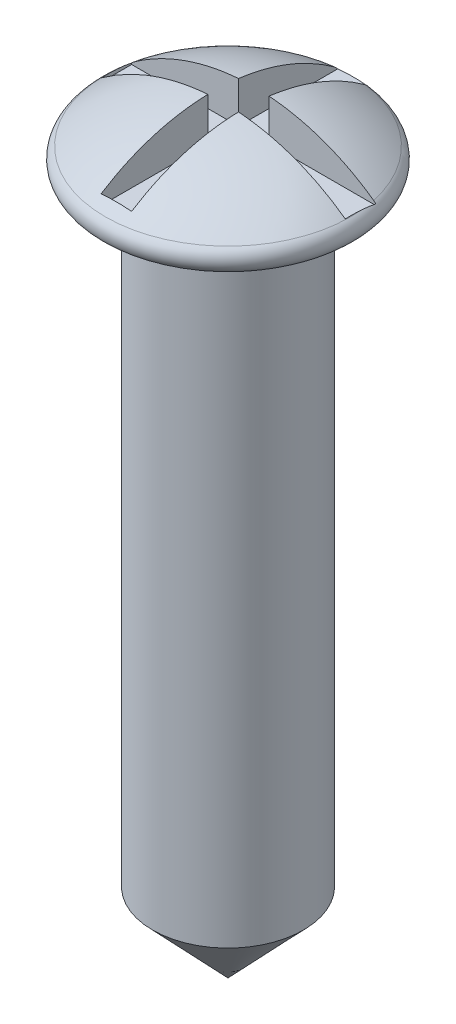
ISO-10303-21;
HEADER;
FILE_DESCRIPTION(('STEP AP214'),'2;1');
FILE_NAME('part.step','',(''),(''),'','','');
FILE_SCHEMA(('AUTOMOTIVE_DESIGN { 1 0 10303 214 1 1 1 1 }'));
ENDSEC;
DATA;
#1=APPLICATION_CONTEXT('core data for automotive mechanical design processes');
#2=APPLICATION_PROTOCOL_DEFINITION('international standard','automotive_design',2000,#1);
#3=PRODUCT_CONTEXT('',#1,'mechanical');
#4=PRODUCT('Part','Part','',(#3));
#5=PRODUCT_RELATED_PRODUCT_CATEGORY('part','',(#4));
#6=PRODUCT_DEFINITION_FORMATION('','',#4);
#7=PRODUCT_DEFINITION_CONTEXT('part definition',#1,'design');
#8=PRODUCT_DEFINITION('design','',#6,#7);
#9=PRODUCT_DEFINITION_SHAPE('','',#8);
#10=(LENGTH_UNIT() NAMED_UNIT(*) SI_UNIT(.MILLI.,.METRE.));
#11=(NAMED_UNIT(*) PLANE_ANGLE_UNIT() SI_UNIT($,.RADIAN.));
#12=(NAMED_UNIT(*) SI_UNIT($,.STERADIAN.) SOLID_ANGLE_UNIT());
#13=UNCERTAINTY_MEASURE_WITH_UNIT(LENGTH_MEASURE(1.E-05),#10,'distance_accuracy_value','');
#14=(GEOMETRIC_REPRESENTATION_CONTEXT(3) GLOBAL_UNCERTAINTY_ASSIGNED_CONTEXT((#13)) GLOBAL_UNIT_ASSIGNED_CONTEXT((#10,
#11,#12)) REPRESENTATION_CONTEXT('',''));
#15=CARTESIAN_POINT('',(0.,0.,0.));
#16=DIRECTION('',(0.,0.,1.));
#17=DIRECTION('',(1.,0.,0.));
#18=AXIS2_PLACEMENT_3D('',#15,#16,#17);
#19=CARTESIAN_POINT('',(0.,-1.04082556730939,0.));
#20=DIRECTION('',(0.,1.,0.));
#21=DIRECTION('',(1.,0.,0.));
#22=AXIS2_PLACEMENT_3D('',#19,#20,#21);
#23=SPHERICAL_SURFACE('',#22,1.51437045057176);
#24=CARTESIAN_POINT('',(0.,0.180659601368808,0.));
#25=DIRECTION('',(0.,-1.,0.));
#26=DIRECTION('',(0.,0.,-1.));
#27=AXIS2_PLACEMENT_3D('',#24,#25,#26);
#28=CIRCLE('',#27,0.895149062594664);
#29=CARTESIAN_POINT('',(-0.111390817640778,0.180659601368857,-0.888191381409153));
#30=VERTEX_POINT('',#29);
#31=CARTESIAN_POINT('',(-0.87523406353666,0.18065960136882,-0.187768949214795));
#32=VERTEX_POINT('',#31);
#33=EDGE_CURVE('E230',#30,#32,#28,.F.);
#34=ORIENTED_EDGE('',*,*,#33,.T.);
#35=CARTESIAN_POINT('',(0.,-1.04082556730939,-0.187768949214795));
#36=DIRECTION('',(0.,0.,-1.));
#37=DIRECTION('',(-1.,0.,0.));
#38=AXIS2_PLACEMENT_3D('',#35,#36,#37);
#39=CIRCLE('',#38,1.502684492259);
#40=CARTESIAN_POINT('',(-0.111390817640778,0.457724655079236,-0.187768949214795));
#41=VERTEX_POINT('',#40);
#42=EDGE_CURVE('E217',#32,#41,#39,.T.);
#43=ORIENTED_EDGE('',*,*,#42,.T.);
#44=CARTESIAN_POINT('',(-0.111390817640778,-1.04082556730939,0.));
#45=DIRECTION('',(-1.,0.,0.));
#46=DIRECTION('',(0.,0.,1.));
#47=AXIS2_PLACEMENT_3D('',#44,#45,#46);
#48=CIRCLE('',#47,1.51026817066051);
#49=EDGE_CURVE('E214',#41,#30,#48,.T.);
#50=ORIENTED_EDGE('',*,*,#49,.T.);
#51=EDGE_LOOP('',(#34,#43,#50));
#52=FACE_BOUND('',#51,.T.);
#53=ADVANCED_FACE('F33',(#52),#23,.T.);
#54=CARTESIAN_POINT('',(0.875234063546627,0.180659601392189,-0.187768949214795));
#55=VERTEX_POINT('',#54);
#56=CARTESIAN_POINT('',(0.111390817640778,0.180659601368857,-0.888191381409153));
#57=VERTEX_POINT('',#56);
#58=EDGE_CURVE('E229',#55,#57,#28,.F.);
#59=ORIENTED_EDGE('',*,*,#58,.T.);
#60=CARTESIAN_POINT('',(0.111390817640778,-1.04082556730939,0.));
#61=DIRECTION('',(1.,0.,0.));
#62=DIRECTION('',(0.,0.,-1.));
#63=AXIS2_PLACEMENT_3D('',#60,#61,#62);
#64=CIRCLE('',#63,1.51026817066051);
#65=CARTESIAN_POINT('',(0.111390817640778,0.457724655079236,-0.187768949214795));
#66=VERTEX_POINT('',#65);
#67=EDGE_CURVE('E211',#57,#66,#64,.T.);
#68=ORIENTED_EDGE('',*,*,#67,.T.);
#69=CARTESIAN_POINT('',(0.,-1.04082556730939,-0.187768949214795));
#70=DIRECTION('',(0.,0.,-1.));
#71=DIRECTION('',(-1.,0.,0.));
#72=AXIS2_PLACEMENT_3D('',#69,#70,#71);
#73=CIRCLE('',#72,1.502684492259);
#74=EDGE_CURVE('E208',#66,#55,#73,.T.);
#75=ORIENTED_EDGE('',*,*,#74,.T.);
#76=EDGE_LOOP('',(#59,#68,#75));
#77=FACE_BOUND('',#76,.T.);
#78=ADVANCED_FACE('F310',(#77),#23,.T.);
#79=CARTESIAN_POINT('',(0.,-5.07765630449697,0.));
#80=DIRECTION('',(0.,1.,0.));
#81=DIRECTION('',(0.,0.,1.));
#82=AXIS2_PLACEMENT_3D('',#79,#80,#81);
#83=CONICAL_SURFACE('',#82,0.,0.760877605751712);
#84=CARTESIAN_POINT('',(0.,-4.5,0.));
#85=DIRECTION('',(0.,1.,0.));
#86=DIRECTION('',(0.,0.,1.));
#87=AXIS2_PLACEMENT_3D('',#84,#85,#86);
#88=CIRCLE('',#87,0.550000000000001);
#89=CARTESIAN_POINT('',(0.,-4.5,0.550000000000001));
#90=VERTEX_POINT('',#89);
#91=EDGE_CURVE('E226',#90,#90,#88,.T.);
#92=ORIENTED_EDGE('',*,*,#91,.F.);
#93=EDGE_LOOP('',(#92));
#94=FACE_BOUND('',#93,.T.);
#95=CARTESIAN_POINT('',(0.,-5.07765630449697,0.));
#96=VERTEX_POINT('',#95);
#97=VERTEX_LOOP('',#96);
#98=FACE_BOUND('',#97,.T.);
#99=ADVANCED_FACE('F317',(#94,#98),#83,.T.);
#100=CARTESIAN_POINT('',(0.,3.8000547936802,0.));
#101=DIRECTION('',(0.,1.,0.));
#102=DIRECTION('',(0.,0.,1.));
#103=AXIS2_PLACEMENT_3D('',#100,#101,#102);
#104=CYLINDRICAL_SURFACE('',#103,0.550000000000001);
#105=CARTESIAN_POINT('',(0.,0.,0.));
#106=DIRECTION('',(0.,1.,0.));
#107=DIRECTION('',(0.,0.,1.));
#108=AXIS2_PLACEMENT_3D('',#105,#106,#107);
#109=CIRCLE('',#108,0.550000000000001);
#110=CARTESIAN_POINT('',(0.,0.,0.550000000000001));
#111=VERTEX_POINT('',#110);
#112=EDGE_CURVE('E223',#111,#111,#109,.T.);
#113=ORIENTED_EDGE('',*,*,#112,.F.);
#114=EDGE_LOOP('',(#113));
#115=FACE_BOUND('',#114,.T.);
#116=ORIENTED_EDGE('',*,*,#91,.T.);
#117=EDGE_LOOP('',(#116));
#118=FACE_BOUND('',#117,.T.);
#119=ADVANCED_FACE('F329',(#115,#118),#104,.T.);
#120=CARTESIAN_POINT('',(1.1,0.,0.));
#121=DIRECTION('',(0.,1.,0.));
#122=DIRECTION('',(0.,0.,1.));
#123=AXIS2_PLACEMENT_3D('',#120,#121,#122);
#124=PLANE('',#123);
#125=CARTESIAN_POINT('',(0.,0.,0.));
#126=DIRECTION('',(0.,1.,0.));
#127=DIRECTION('',(0.,0.,1.));
#128=AXIS2_PLACEMENT_3D('',#125,#126,#127);
#129=CIRCLE('',#128,0.836038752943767);
#130=CARTESIAN_POINT('',(0.,0.,0.836038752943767));
#131=VERTEX_POINT('',#130);
#132=EDGE_CURVE('E233',#131,#131,#129,.F.);
#133=ORIENTED_EDGE('',*,*,#132,.T.);
#134=EDGE_LOOP('',(#133));
#135=FACE_BOUND('',#134,.T.);
#136=ORIENTED_EDGE('',*,*,#112,.T.);
#137=EDGE_LOOP('',(#136));
#138=FACE_BOUND('',#137,.T.);
#139=ADVANCED_FACE('F322',(#135,#138),#124,.F.);
#140=CARTESIAN_POINT('',(0.,-1.04082556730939,0.0350126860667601));
#141=DIRECTION('',(0.,0.,1.));
#142=DIRECTION('',(1.,0.,0.));
#143=AXIS2_PLACEMENT_3D('',#140,#141,#142);
#144=CIRCLE('',#143,1.51396564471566);
#145=CARTESIAN_POINT('',(-0.111390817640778,0.469036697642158,0.0350126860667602));
#146=VERTEX_POINT('',#145);
#147=CARTESIAN_POINT('',(-0.891247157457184,0.183008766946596,0.0350126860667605));
#148=VERTEX_POINT('',#147);
#149=EDGE_CURVE('E11',#146,#148,#144,.T.);
#150=ORIENTED_EDGE('',*,*,#149,.T.);
#151=CARTESIAN_POINT('',(-0.891247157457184,-1.04082556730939,0.));
#152=DIRECTION('',(-1.,0.,0.));
#153=DIRECTION('',(0.,0.,1.));
#154=AXIS2_PLACEMENT_3D('',#151,#152,#153);
#155=CIRCLE('',#154,1.22433507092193);
#156=CARTESIAN_POINT('',(-0.891247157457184,0.180659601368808,-0.083488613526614));
#157=VERTEX_POINT('',#156);
#158=EDGE_CURVE('E220',#148,#157,#155,.T.);
#159=ORIENTED_EDGE('',*,*,#158,.T.);
#160=CARTESIAN_POINT('',(0.891247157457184,0.180659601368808,-0.0834886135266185));
#161=VERTEX_POINT('',#160);
#162=EDGE_CURVE('E234',#157,#161,#28,.F.);
#163=ORIENTED_EDGE('',*,*,#162,.T.);
#164=CARTESIAN_POINT('',(0.891247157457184,-1.04082556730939,0.));
#165=DIRECTION('',(1.,0.,0.));
#166=DIRECTION('',(0.,0.,-1.));
#167=AXIS2_PLACEMENT_3D('',#164,#165,#166);
#168=CIRCLE('',#167,1.22433507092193);
#169=CARTESIAN_POINT('',(0.891247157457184,0.183008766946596,0.03501268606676));
#170=VERTEX_POINT('',#169);
#171=EDGE_CURVE('E183',#161,#170,#168,.T.);
#172=ORIENTED_EDGE('',*,*,#171,.T.);
#173=CARTESIAN_POINT('',(0.,-1.04082556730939,0.0350126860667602));
#174=DIRECTION('',(0.,0.,1.));
#175=DIRECTION('',(1.,0.,0.));
#176=AXIS2_PLACEMENT_3D('',#173,#174,#175);
#177=CIRCLE('',#176,1.51396564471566);
#178=CARTESIAN_POINT('',(0.111390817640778,0.469036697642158,0.0350126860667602));
#179=VERTEX_POINT('',#178);
#180=EDGE_CURVE('E341',#170,#179,#177,.T.);
#181=ORIENTED_EDGE('',*,*,#180,.T.);
#182=CARTESIAN_POINT('',(0.111390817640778,-1.04082556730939,0.));
#183=DIRECTION('',(1.,0.,0.));
#184=DIRECTION('',(0.,0.,-1.));
#185=AXIS2_PLACEMENT_3D('',#182,#183,#184);
#186=CIRCLE('',#185,1.51026817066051);
#187=CARTESIAN_POINT('',(0.111390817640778,0.230747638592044,0.814869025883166));
#188=VERTEX_POINT('',#187);
#189=EDGE_CURVE('E144',#179,#188,#186,.T.);
#190=ORIENTED_EDGE('',*,*,#189,.T.);
#191=CARTESIAN_POINT('',(0.,-1.04082556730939,0.814869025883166));
#192=DIRECTION('',(0.,0.,1.));
#193=DIRECTION('',(1.,0.,0.));
#194=AXIS2_PLACEMENT_3D('',#191,#192,#193);
#195=CIRCLE('',#194,1.27644284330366);
#196=CARTESIAN_POINT('',(-0.111390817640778,0.230747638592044,0.814869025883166));
#197=VERTEX_POINT('',#196);
#198=EDGE_CURVE('E342',#188,#197,#195,.T.);
#199=ORIENTED_EDGE('',*,*,#198,.T.);
#200=CARTESIAN_POINT('',(-0.111390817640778,-1.04082556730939,0.));
#201=DIRECTION('',(-1.,0.,0.));
#202=DIRECTION('',(0.,0.,1.));
#203=AXIS2_PLACEMENT_3D('',#200,#201,#202);
#204=CIRCLE('',#203,1.51026817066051);
#205=EDGE_CURVE('E42',#197,#146,#204,.T.);
#206=ORIENTED_EDGE('',*,*,#205,.T.);
#207=EDGE_LOOP('',(#150,#159,#163,#172,#181,#190,#199,#206));
#208=FACE_BOUND('',#207,.T.);
#209=ADVANCED_FACE('F313',(#208),#23,.T.);
#210=CARTESIAN_POINT('',(0.,0.0999999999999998,0.));
#211=DIRECTION('',(0.,1.,0.));
#212=DIRECTION('',(0.,0.,1.));
#213=AXIS2_PLACEMENT_3D('',#210,#211,#212);
#214=TOROIDAL_SURFACE('',#213,0.836038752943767,0.1);
#215=CARTESIAN_POINT('',(-0.891247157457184,0.181064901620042,-0.0772873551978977));
#216=CARTESIAN_POINT('',(-0.891247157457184,0.182107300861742,-0.0605883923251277));
#217=CARTESIAN_POINT('',(-0.891247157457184,0.18276334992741,-0.043866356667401));
#218=CARTESIAN_POINT('',(-0.891247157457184,0.183444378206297,-0.0104090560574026));
#219=CARTESIAN_POINT('',(-0.891247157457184,0.183469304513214,0.00632620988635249));
#220=CARTESIAN_POINT('',(-0.891247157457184,0.182891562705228,0.039810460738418));
#221=CARTESIAN_POINT('',(-0.891247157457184,0.182287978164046,0.0565594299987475));
#222=CARTESIAN_POINT('',(-0.891247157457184,0.180326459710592,0.0900090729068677));
#223=CARTESIAN_POINT('',(-0.891247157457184,0.178968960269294,0.106709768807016));
#224=CARTESIAN_POINT('',(-0.891247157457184,0.175196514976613,0.139998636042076));
#225=CARTESIAN_POINT('',(-0.891247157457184,0.172781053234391,0.15658674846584));
#226=CARTESIAN_POINT('',(-0.891247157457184,0.166316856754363,0.189517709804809));
#227=CARTESIAN_POINT('',(-0.891247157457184,0.162266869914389,0.205860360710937));
#228=CARTESIAN_POINT('',(-0.891247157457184,0.153902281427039,0.229679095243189));
#229=CARTESIAN_POINT('',(-0.891247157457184,0.150708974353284,0.237543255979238));
#230=CARTESIAN_POINT('',(-0.891247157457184,0.143159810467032,0.252695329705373));
#231=CARTESIAN_POINT('',(-0.891247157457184,0.138812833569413,0.259987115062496));
#232=CARTESIAN_POINT('',(-0.891247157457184,0.13154214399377,0.269005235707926));
#233=CARTESIAN_POINT('',(-0.891247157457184,0.129421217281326,0.271366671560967));
#234=CARTESIAN_POINT('',(-0.891247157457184,0.124855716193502,0.275754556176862));
#235=CARTESIAN_POINT('',(-0.891247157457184,0.122412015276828,0.277781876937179));
#236=CARTESIAN_POINT('',(-0.891247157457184,0.118105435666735,0.280686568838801));
#237=CARTESIAN_POINT('',(-0.891247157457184,0.116346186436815,0.281716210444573));
#238=CARTESIAN_POINT('',(-0.891247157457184,0.112688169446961,0.283491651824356));
#239=CARTESIAN_POINT('',(-0.891247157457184,0.110789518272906,0.284237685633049));
#240=CARTESIAN_POINT('',(-0.891247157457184,0.106864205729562,0.285381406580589));
#241=CARTESIAN_POINT('',(-0.891247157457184,0.104836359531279,0.285775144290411));
#242=CARTESIAN_POINT('',(-0.891247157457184,0.100743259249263,0.28614858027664));
#243=CARTESIAN_POINT('',(-0.891247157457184,0.0986780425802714,0.286128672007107));
#244=CARTESIAN_POINT('',(-0.891247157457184,0.0948869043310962,0.285711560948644));
#245=CARTESIAN_POINT('',(-0.891247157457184,0.0931546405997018,0.285368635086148));
#246=CARTESIAN_POINT('',(-0.891247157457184,0.0897659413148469,0.284414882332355));
#247=CARTESIAN_POINT('',(-0.891247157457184,0.0881095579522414,0.283803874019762));
#248=CARTESIAN_POINT('',(-0.891247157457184,0.084201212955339,0.282045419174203));
#249=CARTESIAN_POINT('',(-0.891247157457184,0.0820025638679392,0.280780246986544));
#250=CARTESIAN_POINT('',(-0.891247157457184,0.0778309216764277,0.277921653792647));
#251=CARTESIAN_POINT('',(-0.891247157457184,0.0758585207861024,0.276327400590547));
#252=CARTESIAN_POINT('',(-0.891247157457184,0.0707811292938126,0.271684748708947));
#253=CARTESIAN_POINT('',(-0.891247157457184,0.0678809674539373,0.268414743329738));
#254=CARTESIAN_POINT('',(-0.891247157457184,0.0625727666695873,0.261502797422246));
#255=CARTESIAN_POINT('',(-0.891247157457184,0.0601660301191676,0.257859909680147));
#256=CARTESIAN_POINT('',(-0.891247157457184,0.0518764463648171,0.24387326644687));
#257=CARTESIAN_POINT('',(-0.891247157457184,0.0471835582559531,0.232840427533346));
#258=CARTESIAN_POINT('',(-0.891247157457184,0.0392995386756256,0.210250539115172));
#259=CARTESIAN_POINT('',(-0.891247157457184,0.0361190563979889,0.198690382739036));
#260=CARTESIAN_POINT('',(-0.891247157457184,0.0285922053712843,0.166061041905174));
#261=CARTESIAN_POINT('',(-0.891247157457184,0.0253312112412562,0.144743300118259));
#262=CARTESIAN_POINT('',(-0.891247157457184,0.0204974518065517,0.101913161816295));
#263=CARTESIAN_POINT('',(-0.891247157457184,0.0189289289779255,0.0804004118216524));
#264=CARTESIAN_POINT('',(-0.891247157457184,0.0169508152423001,0.0373256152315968));
#265=CARTESIAN_POINT('',(-0.891247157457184,0.0165409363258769,0.0157635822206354));
#266=CARTESIAN_POINT('',(-0.891247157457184,0.0167263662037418,-0.0273630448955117));
#267=CARTESIAN_POINT('',(-0.891247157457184,0.017321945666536,-0.0489276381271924));
#268=CARTESIAN_POINT('',(-0.891247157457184,0.0197251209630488,-0.0917365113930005));
#269=CARTESIAN_POINT('',(-0.891247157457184,0.021518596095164,-0.11298160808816));
#270=CARTESIAN_POINT('',(-0.891247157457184,0.0269094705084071,-0.155234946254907));
#271=CARTESIAN_POINT('',(-0.891247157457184,0.0305011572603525,-0.176243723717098));
#272=CARTESIAN_POINT('',(-0.891247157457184,0.0384952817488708,-0.207204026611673));
#273=CARTESIAN_POINT('',(-0.891247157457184,0.0416165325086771,-0.217481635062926));
#274=CARTESIAN_POINT('',(-0.891247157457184,0.0492154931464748,-0.237541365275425));
#275=CARTESIAN_POINT('',(-0.891247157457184,0.053686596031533,-0.247325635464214));
#276=CARTESIAN_POINT('',(-0.891247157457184,0.0614970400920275,-0.25988154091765));
#277=CARTESIAN_POINT('',(-0.891247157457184,0.0638382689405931,-0.263261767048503));
#278=CARTESIAN_POINT('',(-0.891247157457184,0.0689739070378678,-0.269658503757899));
#279=CARTESIAN_POINT('',(-0.891247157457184,0.0717666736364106,-0.272676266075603));
#280=CARTESIAN_POINT('',(-0.891247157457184,0.0765168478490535,-0.276858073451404));
#281=CARTESIAN_POINT('',(-0.891247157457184,0.078279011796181,-0.278242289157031));
#282=CARTESIAN_POINT('',(-0.891247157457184,0.0819818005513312,-0.280750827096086));
#283=CARTESIAN_POINT('',(-0.891247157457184,0.0839222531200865,-0.281875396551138));
#284=CARTESIAN_POINT('',(-0.891247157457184,0.0876437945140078,-0.283621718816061));
#285=CARTESIAN_POINT('',(-0.891247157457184,0.089400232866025,-0.284295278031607));
#286=CARTESIAN_POINT('',(-0.891247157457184,0.0930010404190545,-0.285339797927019));
#287=CARTESIAN_POINT('',(-0.891247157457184,0.0948453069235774,-0.28571110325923));
#288=CARTESIAN_POINT('',(-0.891247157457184,0.0985812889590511,-0.286113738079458));
#289=CARTESIAN_POINT('',(-0.891247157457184,0.100473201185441,-0.286143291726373));
#290=CARTESIAN_POINT('',(-0.891247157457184,0.104230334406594,-0.285854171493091));
#291=CARTESIAN_POINT('',(-0.891247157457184,0.106095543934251,-0.28553535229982));
#292=CARTESIAN_POINT('',(-0.891247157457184,0.109606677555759,-0.284620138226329));
#293=CARTESIAN_POINT('',(-0.891247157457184,0.111258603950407,-0.284046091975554));
#294=CARTESIAN_POINT('',(-0.891247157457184,0.114465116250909,-0.282673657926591));
#295=CARTESIAN_POINT('',(-0.891247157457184,0.116019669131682,-0.281875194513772));
#296=CARTESIAN_POINT('',(-0.891247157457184,0.120075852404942,-0.279474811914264));
#297=CARTESIAN_POINT('',(-0.891247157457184,0.122476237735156,-0.277702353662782));
#298=CARTESIAN_POINT('',(-0.891247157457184,0.126980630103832,-0.273814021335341));
#299=CARTESIAN_POINT('',(-0.891247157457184,0.129083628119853,-0.271697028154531));
#300=CARTESIAN_POINT('',(-0.891247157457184,0.134745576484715,-0.265307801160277));
#301=CARTESIAN_POINT('',(-0.891247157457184,0.137987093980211,-0.260757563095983));
#302=CARTESIAN_POINT('',(-0.891247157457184,0.143828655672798,-0.251268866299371));
#303=CARTESIAN_POINT('',(-0.891247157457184,0.146426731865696,-0.246329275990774));
#304=CARTESIAN_POINT('',(-0.891247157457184,0.152396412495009,-0.23356611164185));
#305=CARTESIAN_POINT('',(-0.891247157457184,0.155452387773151,-0.225596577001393));
#306=CARTESIAN_POINT('',(-0.891247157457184,0.160820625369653,-0.209406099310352));
#307=CARTESIAN_POINT('',(-0.891247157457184,0.163131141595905,-0.201184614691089));
#308=CARTESIAN_POINT('',(-0.891247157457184,0.169269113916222,-0.176282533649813));
#309=CARTESIAN_POINT('',(-0.891247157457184,0.172287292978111,-0.159404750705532));
#310=CARTESIAN_POINT('',(-0.891247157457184,0.176184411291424,-0.131626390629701));
#311=CARTESIAN_POINT('',(-0.891247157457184,0.177442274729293,-0.120768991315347));
#312=CARTESIAN_POINT('',(-0.891247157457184,0.179542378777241,-0.0990400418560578));
#313=CARTESIAN_POINT('',(-0.891247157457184,0.180385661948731,-0.088168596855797));
#314=CARTESIAN_POINT('',(-0.891247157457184,0.181064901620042,-0.0772873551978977));
#315=B_SPLINE_CURVE_WITH_KNOTS('',3,(#215,#216,#217,#218,#219,#220,#221,#222,#223,#224,#225,
#226,#227,#228,#229,#230,#231,#232,#233,#234,#235,#236,#237,#238,#239,#240,#241,#242,#243,#244,
#245,#246,#247,#248,#249,#250,#251,#252,#253,#254,#255,#256,#257,#258,#259,#260,#261,#262,#263,
#264,#265,#266,#267,#268,#269,#270,#271,#272,#273,#274,#275,#276,#277,#278,#279,#280,#281,#282,
#283,#284,#285,#286,#287,#288,#289,#290,#291,#292,#293,#294,#295,#296,#297,#298,#299,#300,#301,
#302,#303,#304,#305,#306,#307,#308,#309,#310,#311,#312,#313,#314),.UNSPECIFIED.,.T.,.F.,(4,2,2,
2,2,2,2,2,2,2,2,2,2,2,2,2,2,2,2,2,2,2,2,2,2,2,2,2,2,2,2,2,2,2,2,2,2,2,2,2,2,2,2,2,2,2,2,2,2,4),
(0.,0.050190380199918,0.100384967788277,0.150652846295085,0.200891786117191,0.251155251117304,
0.301457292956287,0.326883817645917,0.352120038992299,0.361619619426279,0.371094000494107,
0.377189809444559,0.383280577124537,0.389438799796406,0.395591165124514,0.400865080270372,
0.406142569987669,0.413709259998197,0.421295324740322,0.434333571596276,0.447405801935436,
0.48309436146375,0.519030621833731,0.583555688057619,0.648242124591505,0.712912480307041,
0.777600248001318,0.841538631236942,0.905275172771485,0.937464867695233,0.969499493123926,
0.981810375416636,0.994077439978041,1.00078347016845,1.00748308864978,1.01310393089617,
1.01871835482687,1.02436193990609,1.03000787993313,1.03523493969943,1.04046376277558,
1.04936323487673,1.05829221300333,1.07495830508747,1.0916747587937,1.1172153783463,
1.1428153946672,1.19414442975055,1.22693195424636,1.25963659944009),.UNSPECIFIED.);
#316=CARTESIAN_POINT('',(-0.891247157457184,0.166399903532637,-0.187768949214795));
#317=VERTEX_POINT('',#316);
#318=EDGE_CURVE('E278',#317,#157,#315,.T.);
#319=ORIENTED_EDGE('',*,*,#318,.F.);
#320=CARTESIAN_POINT('',(-0.851996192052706,0.193138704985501,-0.187768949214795));
#321=CARTESIAN_POINT('',(-0.857350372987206,0.191094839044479,-0.187768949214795));
#322=CARTESIAN_POINT('',(-0.862538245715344,0.188604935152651,-0.187768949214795));
#323=CARTESIAN_POINT('',(-0.872429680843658,0.182792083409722,-0.187768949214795));
#324=CARTESIAN_POINT('',(-0.877132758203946,0.179468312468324,-0.187768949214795));
#325=CARTESIAN_POINT('',(-0.885913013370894,0.172071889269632,-0.187768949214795));
#326=CARTESIAN_POINT('',(-0.889989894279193,0.167998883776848,-0.187768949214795));
#327=CARTESIAN_POINT('',(-0.897387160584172,0.159216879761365,-0.187768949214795));
#328=CARTESIAN_POINT('',(-0.900707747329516,0.154508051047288,-0.187768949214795));
#329=CARTESIAN_POINT('',(-0.906440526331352,0.144668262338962,-0.187768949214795));
#330=CARTESIAN_POINT('',(-0.908866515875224,0.139545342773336,-0.187768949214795));
#331=CARTESIAN_POINT('',(-0.912806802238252,0.128959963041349,-0.187768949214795));
#332=CARTESIAN_POINT('',(-0.914321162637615,0.123497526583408,-0.187768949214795));
#333=CARTESIAN_POINT('',(-0.916371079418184,0.112489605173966,-0.187768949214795));
#334=CARTESIAN_POINT('',(-0.916923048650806,0.106947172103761,-0.187768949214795));
#335=CARTESIAN_POINT('',(-0.917081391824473,0.0958489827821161,-0.187768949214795));
#336=CARTESIAN_POINT('',(-0.916687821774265,0.0902932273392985,-0.187768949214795));
#337=CARTESIAN_POINT('',(-0.914973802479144,0.0793667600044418,-0.187768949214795));
#338=CARTESIAN_POINT('',(-0.913659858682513,0.0739950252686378,-0.187768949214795));
#339=CARTESIAN_POINT('',(-0.910153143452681,0.0635467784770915,-0.187768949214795));
#340=CARTESIAN_POINT('',(-0.90796036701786,0.0584702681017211,-0.187768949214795));
#341=CARTESIAN_POINT('',(-0.90274995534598,0.0487272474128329,-0.187768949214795));
#342=CARTESIAN_POINT('',(-0.899728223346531,0.044062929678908,-0.187768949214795));
#343=CARTESIAN_POINT('',(-0.892955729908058,0.0352979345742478,-0.187768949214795));
#344=CARTESIAN_POINT('',(-0.889204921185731,0.0311972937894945,-0.187768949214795));
#345=CARTESIAN_POINT('',(-0.881020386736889,0.0236065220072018,-0.187768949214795));
#346=CARTESIAN_POINT('',(-0.876576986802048,0.0201268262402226,-0.187768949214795));
#347=CARTESIAN_POINT('',(-0.867179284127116,0.0139444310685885,-0.187768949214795));
#348=CARTESIAN_POINT('',(-0.862224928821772,0.0112418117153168,-0.187768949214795));
#349=CARTESIAN_POINT('',(-0.851832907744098,0.00662872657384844,-0.187768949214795));
#350=CARTESIAN_POINT('',(-0.846387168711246,0.00473644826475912,-0.187768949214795));
#351=CARTESIAN_POINT('',(-0.835258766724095,0.00187271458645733,-0.187768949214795));
#352=CARTESIAN_POINT('',(-0.829576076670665,0.000901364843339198,-0.187768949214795));
#353=CARTESIAN_POINT('',(-0.818012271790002,-0.000110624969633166,-0.187768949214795));
#354=CARTESIAN_POINT('',(-0.812129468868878,-0.000132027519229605,-0.187768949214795));
#355=CARTESIAN_POINT('',(-0.800441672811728,0.000801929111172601,-0.187768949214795));
#356=CARTESIAN_POINT('',(-0.794636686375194,0.00175737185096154,-0.187768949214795));
#357=CARTESIAN_POINT('',(-0.783206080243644,0.00463482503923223,-0.187768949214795));
#358=CARTESIAN_POINT('',(-0.777582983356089,0.00656687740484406,-0.187768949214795));
#359=CARTESIAN_POINT('',(-0.766743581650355,0.0113533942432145,-0.187768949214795));
#360=CARTESIAN_POINT('',(-0.761527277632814,0.0142078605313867,-0.187768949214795));
#361=CARTESIAN_POINT('',(-0.751690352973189,0.0207446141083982,-0.187768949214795));
#362=CARTESIAN_POINT('',(-0.747066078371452,0.024421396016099,-0.187768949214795));
#363=CARTESIAN_POINT('',(-0.738519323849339,0.0325165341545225,-0.187768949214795));
#364=CARTESIAN_POINT('',(-0.734596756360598,0.0369347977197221,-0.187768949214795));
#365=CARTESIAN_POINT('',(-0.727669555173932,0.0462759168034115,-0.187768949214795));
#366=CARTESIAN_POINT('',(-0.724645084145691,0.0511840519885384,-0.187768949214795));
#367=CARTESIAN_POINT('',(-0.719493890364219,0.0614508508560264,-0.187768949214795));
#368=CARTESIAN_POINT('',(-0.717366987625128,0.0668094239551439,-0.187768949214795));
#369=CARTESIAN_POINT('',(-0.714138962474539,0.0776456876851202,-0.187768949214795));
#370=CARTESIAN_POINT('',(-0.713008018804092,0.0831145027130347,-0.187768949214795));
#371=CARTESIAN_POINT('',(-0.711701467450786,0.0941648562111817,-0.187768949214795));
#372=CARTESIAN_POINT('',(-0.711525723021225,0.0997463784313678,-0.187768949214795));
#373=CARTESIAN_POINT('',(-0.712129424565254,0.110743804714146,-0.187768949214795));
#374=CARTESIAN_POINT('',(-0.712889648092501,0.116160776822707,-0.187768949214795));
#375=CARTESIAN_POINT('',(-0.715306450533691,0.126790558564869,-0.187768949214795));
#376=CARTESIAN_POINT('',(-0.716963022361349,0.13200336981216,-0.187768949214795));
#377=CARTESIAN_POINT('',(-0.721123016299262,0.142096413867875,-0.187768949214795));
#378=CARTESIAN_POINT('',(-0.723628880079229,0.146975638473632,-0.187768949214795));
#379=CARTESIAN_POINT('',(-0.72940610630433,0.15625722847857,-0.187768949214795));
#380=CARTESIAN_POINT('',(-0.732677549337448,0.160659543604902,-0.187768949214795));
#381=CARTESIAN_POINT('',(-0.739972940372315,0.168975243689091,-0.187768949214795));
#382=CARTESIAN_POINT('',(-0.744012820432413,0.172874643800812,-0.187768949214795));
#383=CARTESIAN_POINT('',(-0.7526727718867,0.179964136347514,-0.187768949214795));
#384=CARTESIAN_POINT('',(-0.757292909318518,0.183154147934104,-0.187768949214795));
#385=CARTESIAN_POINT('',(-0.767132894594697,0.188835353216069,-0.187768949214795));
#386=CARTESIAN_POINT('',(-0.772366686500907,0.19130240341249,-0.187768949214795));
#387=CARTESIAN_POINT('',(-0.783169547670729,0.19534510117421,-0.187768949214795));
#388=CARTESIAN_POINT('',(-0.788738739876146,0.196920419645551,-0.187768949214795));
#389=CARTESIAN_POINT('',(-0.800186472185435,0.199165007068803,-0.187768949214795));
#390=CARTESIAN_POINT('',(-0.806069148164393,0.199813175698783,-0.187768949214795));
#391=CARTESIAN_POINT('',(-0.817855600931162,0.200116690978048,-0.187768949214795));
#392=CARTESIAN_POINT('',(-0.823759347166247,0.199773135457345,-0.187768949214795));
#393=CARTESIAN_POINT('',(-0.833416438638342,0.198389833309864,-0.187768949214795));
#394=CARTESIAN_POINT('',(-0.837212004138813,0.197629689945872,-0.187768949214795));
#395=CARTESIAN_POINT('',(-0.844695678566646,0.195693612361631,-0.187768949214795));
#396=CARTESIAN_POINT('',(-0.848383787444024,0.194517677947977,-0.187768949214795));
#397=CARTESIAN_POINT('',(-0.851996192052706,0.193138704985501,-0.187768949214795));
#398=B_SPLINE_CURVE_WITH_KNOTS('',3,(#320,#321,#322,#323,#324,#325,#326,#327,#328,#329,#330,
#331,#332,#333,#334,#335,#336,#337,#338,#339,#340,#341,#342,#343,#344,#345,#346,#347,#348,#349,
#350,#351,#352,#353,#354,#355,#356,#357,#358,#359,#360,#361,#362,#363,#364,#365,#366,#367,#368,
#369,#370,#371,#372,#373,#374,#375,#376,#377,#378,#379,#380,#381,#382,#383,#384,#385,#386,#387,
#388,#389,#390,#391,#392,#393,#394,#395,#396,#397),.UNSPECIFIED.,.T.,.F.,(4,2,2,2,2,2,2,2,2,2,2,
2,2,2,2,2,2,2,2,2,2,2,2,2,2,2,2,2,2,2,2,2,2,2,2,2,2,2,4),(0.,0.0171793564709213,
0.0343757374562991,0.0515802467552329,0.0687801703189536,0.0857024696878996,0.102623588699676,
0.119253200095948,0.135881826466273,0.152394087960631,0.168906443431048,0.185501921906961,
0.202098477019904,0.218951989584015,0.235807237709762,0.253023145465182,0.27024102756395,
0.287807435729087,0.305375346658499,0.323127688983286,0.340880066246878,0.358516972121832,
0.376151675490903,0.393361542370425,0.410567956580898,0.427239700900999,0.443909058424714,
0.460241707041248,0.476574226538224,0.492954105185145,0.509335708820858,0.52610378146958,
0.542873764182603,0.560152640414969,0.577437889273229,0.595110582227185,0.612763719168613,
0.624354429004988,0.635945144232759),.UNSPECIFIED.);
#399=EDGE_CURVE('E271',#32,#317,#398,.T.);
#400=ORIENTED_EDGE('',*,*,#399,.F.);
#401=ORIENTED_EDGE('',*,*,#33,.F.);
#402=CARTESIAN_POINT('',(-0.111390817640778,0.175215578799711,-0.89503237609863));
#403=CARTESIAN_POINT('',(-0.111390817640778,0.178939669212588,-0.890748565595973));
#404=CARTESIAN_POINT('',(-0.111390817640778,0.182302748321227,-0.886145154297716));
#405=CARTESIAN_POINT('',(-0.111390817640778,0.188209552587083,-0.876434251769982));
#406=CARTESIAN_POINT('',(-0.111390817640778,0.190752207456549,-0.871326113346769));
#407=CARTESIAN_POINT('',(-0.111390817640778,0.194943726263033,-0.86075967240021));
#408=CARTESIAN_POINT('',(-0.111390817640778,0.196593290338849,-0.855301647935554));
#409=CARTESIAN_POINT('',(-0.111390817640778,0.198957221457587,-0.844188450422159));
#410=CARTESIAN_POINT('',(-0.111390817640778,0.19967182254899,-0.83853332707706));
#411=CARTESIAN_POINT('',(-0.111390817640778,0.200149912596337,-0.827154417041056));
#412=CARTESIAN_POINT('',(-0.111390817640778,0.199908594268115,-0.821430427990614));
#413=CARTESIAN_POINT('',(-0.111390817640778,0.19847143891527,-0.810103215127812));
#414=CARTESIAN_POINT('',(-0.111390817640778,0.197275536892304,-0.804499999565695));
#415=CARTESIAN_POINT('',(-0.111390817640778,0.193957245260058,-0.793557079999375));
#416=CARTESIAN_POINT('',(-0.111390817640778,0.19183218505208,-0.78821818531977));
#417=CARTESIAN_POINT('',(-0.111390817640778,0.186713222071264,-0.777974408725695));
#418=CARTESIAN_POINT('',(-0.111390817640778,0.183719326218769,-0.773069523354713));
#419=CARTESIAN_POINT('',(-0.111390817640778,0.176955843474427,-0.76385099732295));
#420=CARTESIAN_POINT('',(-0.111390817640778,0.173188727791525,-0.759535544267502));
#421=CARTESIAN_POINT('',(-0.111390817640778,0.164977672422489,-0.751605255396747));
#422=CARTESIAN_POINT('',(-0.111390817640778,0.160533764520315,-0.747990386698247));
#423=CARTESIAN_POINT('',(-0.111390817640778,0.151136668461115,-0.741598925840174));
#424=CARTESIAN_POINT('',(-0.111390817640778,0.146188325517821,-0.738815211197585));
#425=CARTESIAN_POINT('',(-0.111390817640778,0.135890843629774,-0.734128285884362));
#426=CARTESIAN_POINT('',(-0.111390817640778,0.130541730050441,-0.732225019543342));
#427=CARTESIAN_POINT('',(-0.111390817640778,0.119655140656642,-0.729373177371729));
#428=CARTESIAN_POINT('',(-0.111390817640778,0.114120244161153,-0.728414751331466));
#429=CARTESIAN_POINT('',(-0.111390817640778,0.10296817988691,-0.727447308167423));
#430=CARTESIAN_POINT('',(-0.111390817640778,0.0973510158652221,-0.727438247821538));
#431=CARTESIAN_POINT('',(-0.111390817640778,0.0862313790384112,-0.728366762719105));
#432=CARTESIAN_POINT('',(-0.111390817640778,0.080728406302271,-0.729298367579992));
#433=CARTESIAN_POINT('',(-0.111390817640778,0.069956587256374,-0.732070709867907));
#434=CARTESIAN_POINT('',(-0.111390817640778,0.0646877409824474,-0.733911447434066));
#435=CARTESIAN_POINT('',(-0.111390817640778,0.0545225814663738,-0.738450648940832));
#436=CARTESIAN_POINT('',(-0.111390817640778,0.0496269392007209,-0.741150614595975));
#437=CARTESIAN_POINT('',(-0.111390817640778,0.040353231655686,-0.747327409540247));
#438=CARTESIAN_POINT('',(-0.111390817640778,0.0359751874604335,-0.750804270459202));
#439=CARTESIAN_POINT('',(-0.111390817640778,0.0278197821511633,-0.75846757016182));
#440=CARTESIAN_POINT('',(-0.111390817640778,0.0240479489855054,-0.762659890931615));
#441=CARTESIAN_POINT('',(-0.111390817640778,0.0172528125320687,-0.771612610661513));
#442=CARTESIAN_POINT('',(-0.111390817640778,0.0142295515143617,-0.776373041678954));
#443=CARTESIAN_POINT('',(-0.111390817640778,0.00898464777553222,-0.786380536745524));
#444=CARTESIAN_POINT('',(-0.111390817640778,0.00677172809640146,-0.791632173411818));
#445=CARTESIAN_POINT('',(-0.111390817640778,0.00325200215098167,-0.802430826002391));
#446=CARTESIAN_POINT('',(-0.111390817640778,0.00194523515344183,-0.807977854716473));
#447=CARTESIAN_POINT('',(-0.111390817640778,0.000267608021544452,-0.819251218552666));
#448=CARTESIAN_POINT('',(-0.111390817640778,-9.66908705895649E-05,-0.824978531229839));
#449=CARTESIAN_POINT('',(-0.111390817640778,0.000140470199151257,-0.836413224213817));
#450=CARTESIAN_POINT('',(-0.111390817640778,0.000741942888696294,-0.842120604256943));
#451=CARTESIAN_POINT('',(-0.111390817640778,0.00289634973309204,-0.853357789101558));
#452=CARTESIAN_POINT('',(-0.111390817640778,0.00445004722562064,-0.858887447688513));
#453=CARTESIAN_POINT('',(-0.111390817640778,0.00846804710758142,-0.869605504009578));
#454=CARTESIAN_POINT('',(-0.111390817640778,0.0109323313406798,-0.874793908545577));
#455=CARTESIAN_POINT('',(-0.111390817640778,0.0166903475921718,-0.88465558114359));
#456=CARTESIAN_POINT('',(-0.111390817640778,0.019980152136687,-0.889331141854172));
#457=CARTESIAN_POINT('',(-0.111390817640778,0.0273035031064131,-0.898058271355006));
#458=CARTESIAN_POINT('',(-0.111390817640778,0.0313370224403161,-0.902109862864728));
#459=CARTESIAN_POINT('',(-0.111390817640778,0.0400011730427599,-0.909441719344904));
#460=CARTESIAN_POINT('',(-0.111390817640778,0.0446271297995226,-0.912727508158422));
#461=CARTESIAN_POINT('',(-0.111390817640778,0.0543682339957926,-0.918469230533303));
#462=CARTESIAN_POINT('',(-0.111390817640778,0.0594833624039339,-0.920925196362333));
#463=CARTESIAN_POINT('',(-0.111390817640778,0.0700182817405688,-0.924919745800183));
#464=CARTESIAN_POINT('',(-0.111390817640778,0.075435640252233,-0.926464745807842));
#465=CARTESIAN_POINT('',(-0.111390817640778,0.0864531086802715,-0.928618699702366));
#466=CARTESIAN_POINT('',(-0.111390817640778,0.0920532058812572,-0.929227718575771));
#467=CARTESIAN_POINT('',(-0.111390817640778,0.103250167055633,-0.929491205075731));
#468=CARTESIAN_POINT('',(-0.111390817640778,0.108846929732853,-0.929150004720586));
#469=CARTESIAN_POINT('',(-0.111390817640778,0.119905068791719,-0.927532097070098));
#470=CARTESIAN_POINT('',(-0.111390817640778,0.125366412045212,-0.926255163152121));
#471=CARTESIAN_POINT('',(-0.111390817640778,0.135997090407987,-0.922803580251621));
#472=CARTESIAN_POINT('',(-0.111390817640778,0.14116641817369,-0.920628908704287));
#473=CARTESIAN_POINT('',(-0.111390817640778,0.151063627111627,-0.91544670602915));
#474=CARTESIAN_POINT('',(-0.111390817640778,0.155792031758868,-0.912440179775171));
#475=CARTESIAN_POINT('',(-0.111390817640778,0.162963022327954,-0.906989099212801));
#476=CARTESIAN_POINT('',(-0.111390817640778,0.165583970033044,-0.904774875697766));
#477=CARTESIAN_POINT('',(-0.111390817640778,0.170585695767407,-0.900090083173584));
#478=CARTESIAN_POINT('',(-0.111390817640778,0.172966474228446,-0.8976195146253));
#479=CARTESIAN_POINT('',(-0.111390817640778,0.175215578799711,-0.89503237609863));
#480=B_SPLINE_CURVE_WITH_KNOTS('',3,(#402,#403,#404,#405,#406,#407,#408,#409,#410,#411,#412,
#413,#414,#415,#416,#417,#418,#419,#420,#421,#422,#423,#424,#425,#426,#427,#428,#429,#430,#431,
#432,#433,#434,#435,#436,#437,#438,#439,#440,#441,#442,#443,#444,#445,#446,#447,#448,#449,#450,
#451,#452,#453,#454,#455,#456,#457,#458,#459,#460,#461,#462,#463,#464,#465,#466,#467,#468,#469,
#470,#471,#472,#473,#474,#475,#476,#477,#478,#479),.UNSPECIFIED.,.T.,.F.,(4,2,2,2,2,2,2,2,2,2,2,
2,2,2,2,2,2,2,2,2,2,2,2,2,2,2,2,2,2,2,2,2,2,2,2,2,2,2,4),(0.,0.0170161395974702,
0.0340543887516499,0.0510792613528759,0.0680998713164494,0.0852061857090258,0.102313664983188,
0.119470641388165,0.136627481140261,0.153730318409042,0.170832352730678,0.187783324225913,
0.204733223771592,0.221504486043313,0.238274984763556,0.254939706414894,0.271604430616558,
0.288298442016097,0.304993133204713,0.321832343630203,0.338672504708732,0.355688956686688,
0.372706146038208,0.389841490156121,0.406977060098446,0.424126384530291,0.44127536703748,
0.458344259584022,0.475412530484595,0.492353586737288,0.509293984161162,0.526113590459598,
0.542932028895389,0.559673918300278,0.576419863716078,0.593166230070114,0.609892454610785,
0.620169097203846,0.630445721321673),.UNSPECIFIED.);
#481=CARTESIAN_POINT('',(-0.111390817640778,0.156537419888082,-0.911742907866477));
#482=VERTEX_POINT('',#481);
#483=EDGE_CURVE('E245',#482,#30,#480,.T.);
#484=ORIENTED_EDGE('',*,*,#483,.F.);
#485=CARTESIAN_POINT('',(0.,0.156537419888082,0.));
#486=DIRECTION('',(0.,1.,0.));
#487=DIRECTION('',(0.,0.,1.));
#488=AXIS2_PLACEMENT_3D('',#485,#486,#487);
#489=CIRCLE('',#488,0.918522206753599);
#490=CARTESIAN_POINT('',(0.111390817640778,0.156537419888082,-0.911742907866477));
#491=VERTEX_POINT('',#490);
#492=EDGE_CURVE('E237',#482,#491,#489,.F.);
#493=ORIENTED_EDGE('',*,*,#492,.T.);
#494=CARTESIAN_POINT('',(0.111390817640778,0.175215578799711,-0.89503237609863));
#495=CARTESIAN_POINT('',(0.111390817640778,0.171532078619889,-0.899268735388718));
#496=CARTESIAN_POINT('',(0.111390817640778,0.167490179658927,-0.903198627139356));
#497=CARTESIAN_POINT('',(0.111390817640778,0.158801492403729,-0.910328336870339));
#498=CARTESIAN_POINT('',(0.111390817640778,0.154154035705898,-0.913527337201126));
#499=CARTESIAN_POINT('',(0.111390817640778,0.144387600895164,-0.919097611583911));
#500=CARTESIAN_POINT('',(0.111390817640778,0.139268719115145,-0.921469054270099));
#501=CARTESIAN_POINT('',(0.111390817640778,0.128705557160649,-0.925314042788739));
#502=CARTESIAN_POINT('',(0.111390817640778,0.123261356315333,-0.926787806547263));
#503=CARTESIAN_POINT('',(0.111390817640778,0.112224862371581,-0.928790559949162));
#504=CARTESIAN_POINT('',(0.111390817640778,0.106633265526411,-0.929323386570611));
#505=CARTESIAN_POINT('',(0.111390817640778,0.0954400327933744,-0.929440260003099));
#506=CARTESIAN_POINT('',(0.111390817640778,0.0898383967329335,-0.929024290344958));
#507=CARTESIAN_POINT('',(0.111390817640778,0.0787982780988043,-0.927257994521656));
#508=CARTESIAN_POINT('',(0.111390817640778,0.073359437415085,-0.925909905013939));
#509=CARTESIAN_POINT('',(0.111390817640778,0.0627846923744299,-0.922321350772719));
#510=CARTESIAN_POINT('',(0.111390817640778,0.0576487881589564,-0.920080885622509));
#511=CARTESIAN_POINT('',(0.111390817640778,0.0478150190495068,-0.914768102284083));
#512=CARTESIAN_POINT('',(0.111390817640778,0.0431179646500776,-0.91169428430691));
#513=CARTESIAN_POINT('',(0.111390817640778,0.0343030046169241,-0.90480571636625));
#514=CARTESIAN_POINT('',(0.111390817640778,0.0301851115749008,-0.900990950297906));
#515=CARTESIAN_POINT('',(0.111390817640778,0.0226206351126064,-0.892707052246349));
#516=CARTESIAN_POINT('',(0.111390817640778,0.0191778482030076,-0.888234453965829));
#517=CARTESIAN_POINT('',(0.111390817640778,0.013085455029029,-0.878778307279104));
#518=CARTESIAN_POINT('',(0.111390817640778,0.0104358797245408,-0.873794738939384));
#519=CARTESIAN_POINT('',(0.111390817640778,0.00598398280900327,-0.86341821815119));
#520=CARTESIAN_POINT('',(0.111390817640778,0.00418816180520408,-0.858022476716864));
#521=CARTESIAN_POINT('',(0.111390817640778,0.0015208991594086,-0.847007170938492));
#522=CARTESIAN_POINT('',(0.111390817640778,0.000649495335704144,-0.841387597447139));
#523=CARTESIAN_POINT('',(0.111390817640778,-0.000149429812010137,-0.830042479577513));
#524=CARTESIAN_POINT('',(0.111390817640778,-7.03600296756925E-05,-0.824316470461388));
#525=CARTESIAN_POINT('',(0.111390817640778,0.00104448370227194,-0.812958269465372));
#526=CARTESIAN_POINT('',(0.111390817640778,0.00208028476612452,-0.807326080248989));
#527=CARTESIAN_POINT('',(0.111390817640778,0.00508502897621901,-0.796295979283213));
#528=CARTESIAN_POINT('',(0.111390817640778,0.00705707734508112,-0.790898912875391));
#529=CARTESIAN_POINT('',(0.111390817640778,0.0118815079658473,-0.780513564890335));
#530=CARTESIAN_POINT('',(0.111390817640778,0.0147338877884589,-0.775525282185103));
#531=CARTESIAN_POINT('',(0.111390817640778,0.0212320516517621,-0.766114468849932));
#532=CARTESIAN_POINT('',(0.111390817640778,0.0248757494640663,-0.761690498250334));
#533=CARTESIAN_POINT('',(0.111390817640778,0.0328598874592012,-0.753523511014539));
#534=CARTESIAN_POINT('',(0.111390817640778,0.0372002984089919,-0.749780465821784));
#535=CARTESIAN_POINT('',(0.111390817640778,0.0464160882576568,-0.743116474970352));
#536=CARTESIAN_POINT('',(0.111390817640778,0.0512866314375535,-0.740188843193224));
#537=CARTESIAN_POINT('',(0.111390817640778,0.0614541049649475,-0.735203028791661));
#538=CARTESIAN_POINT('',(0.111390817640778,0.0667510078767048,-0.733144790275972));
#539=CARTESIAN_POINT('',(0.111390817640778,0.0775603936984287,-0.729978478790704));
#540=CARTESIAN_POINT('',(0.111390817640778,0.0830699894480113,-0.728860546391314));
#541=CARTESIAN_POINT('',(0.111390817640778,0.0941988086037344,-0.727572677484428));
#542=CARTESIAN_POINT('',(0.111390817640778,0.0998180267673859,-0.727402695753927));
#543=CARTESIAN_POINT('',(0.111390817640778,0.110965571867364,-0.728013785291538));
#544=CARTESIAN_POINT('',(0.111390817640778,0.116494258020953,-0.72878833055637));
#545=CARTESIAN_POINT('',(0.111390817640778,0.127343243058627,-0.731253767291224));
#546=CARTESIAN_POINT('',(0.111390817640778,0.132663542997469,-0.732944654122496));
#547=CARTESIAN_POINT('',(0.111390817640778,0.142951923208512,-0.737193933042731));
#548=CARTESIAN_POINT('',(0.111390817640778,0.147919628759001,-0.739753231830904));
#549=CARTESIAN_POINT('',(0.111390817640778,0.157359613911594,-0.745662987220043));
#550=CARTESIAN_POINT('',(0.111390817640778,0.161831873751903,-0.749013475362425));
#551=CARTESIAN_POINT('',(0.111390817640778,0.170194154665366,-0.756439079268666));
#552=CARTESIAN_POINT('',(0.111390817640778,0.174079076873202,-0.76051993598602));
#553=CARTESIAN_POINT('',(0.111390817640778,0.181117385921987,-0.769270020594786));
#554=CARTESIAN_POINT('',(0.111390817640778,0.184270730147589,-0.773939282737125));
#555=CARTESIAN_POINT('',(0.111390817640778,0.189791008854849,-0.783786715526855));
#556=CARTESIAN_POINT('',(0.111390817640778,0.192149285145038,-0.788969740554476));
#557=CARTESIAN_POINT('',(0.111390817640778,0.195969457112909,-0.799656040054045));
#558=CARTESIAN_POINT('',(0.111390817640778,0.197431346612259,-0.805159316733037));
#559=CARTESIAN_POINT('',(0.111390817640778,0.199426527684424,-0.816373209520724));
#560=CARTESIAN_POINT('',(0.111390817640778,0.19995297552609,-0.822085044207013));
#561=CARTESIAN_POINT('',(0.111390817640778,0.20004099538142,-0.83351777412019));
#562=CARTESIAN_POINT('',(0.111390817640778,0.199602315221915,-0.839238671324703));
#563=CARTESIAN_POINT('',(0.111390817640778,0.197769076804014,-0.85053546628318));
#564=CARTESIAN_POINT('',(0.111390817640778,0.196372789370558,-0.856111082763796));
#565=CARTESIAN_POINT('',(0.111390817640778,0.192660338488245,-0.866942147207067));
#566=CARTESIAN_POINT('',(0.111390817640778,0.190345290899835,-0.87219797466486));
#567=CARTESIAN_POINT('',(0.111390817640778,0.185867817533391,-0.88039834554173));
#568=CARTESIAN_POINT('',(0.111390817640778,0.183959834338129,-0.8834845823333));
#569=CARTESIAN_POINT('',(0.111390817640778,0.179822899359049,-0.889433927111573));
#570=CARTESIAN_POINT('',(0.111390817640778,0.177593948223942,-0.892297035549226));
#571=CARTESIAN_POINT('',(0.111390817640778,0.175215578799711,-0.89503237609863));
#572=B_SPLINE_CURVE_WITH_KNOTS('',3,(#494,#495,#496,#497,#498,#499,#500,#501,#502,#503,#504,
#505,#506,#507,#508,#509,#510,#511,#512,#513,#514,#515,#516,#517,#518,#519,#520,#521,#522,#523,
#524,#525,#526,#527,#528,#529,#530,#531,#532,#533,#534,#535,#536,#537,#538,#539,#540,#541,#542,
#543,#544,#545,#546,#547,#548,#549,#550,#551,#552,#553,#554,#555,#556,#557,#558,#559,#560,#561,
#562,#563,#564,#565,#566,#567,#568,#569,#570,#571),.UNSPECIFIED.,.T.,.F.,(4,2,2,2,2,2,2,2,2,2,2,
2,2,2,2,2,2,2,2,2,2,2,2,2,2,2,2,2,2,2,2,2,2,2,2,2,2,2,4),(0.,0.0168283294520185,
0.0336753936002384,0.0505190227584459,0.0673585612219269,0.0841292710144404,0.100900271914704,
0.117631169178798,0.134362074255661,0.151123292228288,0.167884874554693,0.184738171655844,
0.201592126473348,0.218572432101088,0.235553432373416,0.252652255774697,0.26975156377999,
0.286907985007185,0.304064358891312,0.321176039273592,0.338287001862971,0.355253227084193,
0.372218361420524,0.38900331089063,0.405787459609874,0.422456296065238,0.439125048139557,
0.455811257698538,0.472498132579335,0.489322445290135,0.506147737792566,0.523150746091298,
0.540153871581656,0.557280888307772,0.574412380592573,0.591574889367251,0.608716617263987,
0.619582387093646,0.630448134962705),.UNSPECIFIED.);
#573=EDGE_CURVE('E240',#57,#491,#572,.T.);
#574=ORIENTED_EDGE('',*,*,#573,.F.);
#575=ORIENTED_EDGE('',*,*,#58,.F.);
#576=CARTESIAN_POINT('',(0.742491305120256,0.171244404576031,-0.187768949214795));
#577=CARTESIAN_POINT('',(0.738443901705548,0.167379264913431,-0.187768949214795));
#578=CARTESIAN_POINT('',(0.734712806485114,0.163178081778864,-0.187768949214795));
#579=CARTESIAN_POINT('',(0.727999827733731,0.154209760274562,-0.187768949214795));
#580=CARTESIAN_POINT('',(0.725018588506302,0.149442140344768,-0.187768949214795));
#581=CARTESIAN_POINT('',(0.719903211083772,0.139466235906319,-0.187768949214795));
#582=CARTESIAN_POINT('',(0.71776974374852,0.134257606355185,-0.187768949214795));
#583=CARTESIAN_POINT('',(0.714428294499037,0.123552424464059,-0.187768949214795));
#584=CARTESIAN_POINT('',(0.713220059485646,0.118055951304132,-0.187768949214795));
#585=CARTESIAN_POINT('',(0.711785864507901,0.107045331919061,-0.187768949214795));
#586=CARTESIAN_POINT('',(0.711541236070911,0.101533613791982,-0.187768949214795));
#587=CARTESIAN_POINT('',(0.711991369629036,0.0905488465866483,-0.187768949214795));
#588=CARTESIAN_POINT('',(0.712686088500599,0.0850757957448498,-0.187768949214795));
#589=CARTESIAN_POINT('',(0.714978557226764,0.0743808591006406,-0.187768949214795));
#590=CARTESIAN_POINT('',(0.716567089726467,0.0691569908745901,-0.187768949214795));
#591=CARTESIAN_POINT('',(0.720587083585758,0.0590447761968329,-0.187768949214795));
#592=CARTESIAN_POINT('',(0.72301858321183,0.0541564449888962,-0.187768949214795));
#593=CARTESIAN_POINT('',(0.728685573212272,0.0447794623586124,-0.187768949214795));
#594=CARTESIAN_POINT('',(0.731931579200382,0.0402971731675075,-0.187768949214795));
#595=CARTESIAN_POINT('',(0.739110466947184,0.031921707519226,-0.187768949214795));
#596=CARTESIAN_POINT('',(0.743043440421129,0.0280286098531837,-0.187768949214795));
#597=CARTESIAN_POINT('',(0.751605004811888,0.020822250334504,-0.187768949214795));
#598=CARTESIAN_POINT('',(0.756250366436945,0.0175289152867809,-0.187768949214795));
#599=CARTESIAN_POINT('',(0.766015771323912,0.0117435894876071,-0.187768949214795));
#600=CARTESIAN_POINT('',(0.771135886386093,0.00925172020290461,-0.187768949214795));
#601=CARTESIAN_POINT('',(0.781860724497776,0.00506986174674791,-0.187768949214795));
#602=CARTESIAN_POINT('',(0.787475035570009,0.00340443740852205,-0.187768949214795));
#603=CARTESIAN_POINT('',(0.798901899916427,0.00102452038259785,-0.187768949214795));
#604=CARTESIAN_POINT('',(0.80471447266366,0.000310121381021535,-0.187768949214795));
#605=CARTESIAN_POINT('',(0.816462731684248,-0.000151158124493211,-0.187768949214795));
#606=CARTESIAN_POINT('',(0.822398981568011,0.000116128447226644,-0.187768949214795));
#607=CARTESIAN_POINT('',(0.834141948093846,0.00164691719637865,-0.187768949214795));
#608=CARTESIAN_POINT('',(0.839948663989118,0.00291042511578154,-0.187768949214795));
#609=CARTESIAN_POINT('',(0.851243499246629,0.00639887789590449,-0.187768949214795));
#610=CARTESIAN_POINT('',(0.856732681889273,0.00862037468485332,-0.187768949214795));
#611=CARTESIAN_POINT('',(0.867250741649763,0.0139692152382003,-0.187768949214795));
#612=CARTESIAN_POINT('',(0.872279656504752,0.017096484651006,-0.187768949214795));
#613=CARTESIAN_POINT('',(0.881639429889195,0.0241122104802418,-0.187768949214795));
#614=CARTESIAN_POINT('',(0.885980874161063,0.0279865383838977,-0.187768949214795));
#615=CARTESIAN_POINT('',(0.89393329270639,0.0364239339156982,-0.187768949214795));
#616=CARTESIAN_POINT('',(0.897544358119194,0.0409869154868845,-0.187768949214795));
#617=CARTESIAN_POINT('',(0.903848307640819,0.0505626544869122,-0.187768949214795));
#618=CARTESIAN_POINT('',(0.906559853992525,0.0555631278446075,-0.187768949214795));
#619=CARTESIAN_POINT('',(0.911086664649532,0.0659545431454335,-0.187768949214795));
#620=CARTESIAN_POINT('',(0.912902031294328,0.071345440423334,-0.187768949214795));
#621=CARTESIAN_POINT('',(0.915552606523,0.0822571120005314,-0.187768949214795));
#622=CARTESIAN_POINT('',(0.916405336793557,0.0877736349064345,-0.187768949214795));
#623=CARTESIAN_POINT('',(0.917163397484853,0.0988712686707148,-0.187768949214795));
#624=CARTESIAN_POINT('',(0.917068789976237,0.104452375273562,-0.187768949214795));
#625=CARTESIAN_POINT('',(0.915940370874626,0.115468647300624,-0.187768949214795));
#626=CARTESIAN_POINT('',(0.914914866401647,0.120904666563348,-0.187768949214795));
#627=CARTESIAN_POINT('',(0.911968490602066,0.131528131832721,-0.187768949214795));
#628=CARTESIAN_POINT('',(0.91004762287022,0.13671557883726,-0.187768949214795));
#629=CARTESIAN_POINT('',(0.905362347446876,0.146714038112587,-0.187768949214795));
#630=CARTESIAN_POINT('',(0.902595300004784,0.151523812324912,-0.187768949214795));
#631=CARTESIAN_POINT('',(0.896303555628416,0.160618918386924,-0.187768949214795));
#632=CARTESIAN_POINT('',(0.892778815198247,0.164904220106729,-0.187768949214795));
#633=CARTESIAN_POINT('',(0.885020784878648,0.172894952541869,-0.187768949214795));
#634=CARTESIAN_POINT('',(0.880778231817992,0.176591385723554,-0.187768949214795));
#635=CARTESIAN_POINT('',(0.871743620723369,0.183236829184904,-0.187768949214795));
#636=CARTESIAN_POINT('',(0.866951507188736,0.186185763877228,-0.187768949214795));
#637=CARTESIAN_POINT('',(0.85684724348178,0.191318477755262,-0.187768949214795));
#638=CARTESIAN_POINT('',(0.851526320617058,0.193484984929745,-0.187768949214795));
#639=CARTESIAN_POINT('',(0.840601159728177,0.196914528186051,-0.187768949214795));
#640=CARTESIAN_POINT('',(0.834996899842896,0.198177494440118,-0.187768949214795));
#641=CARTESIAN_POINT('',(0.823538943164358,0.199789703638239,-0.187768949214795));
#642=CARTESIAN_POINT('',(0.817682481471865,0.200119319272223,-0.187768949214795));
#643=CARTESIAN_POINT('',(0.805994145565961,0.199803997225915,-0.187768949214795));
#644=CARTESIAN_POINT('',(0.800162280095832,0.199158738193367,-0.187768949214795));
#645=CARTESIAN_POINT('',(0.788610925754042,0.196896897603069,-0.187768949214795));
#646=CARTESIAN_POINT('',(0.782893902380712,0.195267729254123,-0.187768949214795));
#647=CARTESIAN_POINT('',(0.771820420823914,0.191070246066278,-0.187768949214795));
#648=CARTESIAN_POINT('',(0.766463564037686,0.188502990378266,-0.187768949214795));
#649=CARTESIAN_POINT('',(0.75796088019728,0.183496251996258,-0.187768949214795));
#650=CARTESIAN_POINT('',(0.754671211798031,0.181297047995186,-0.187768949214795));
#651=CARTESIAN_POINT('',(0.748365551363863,0.176535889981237,-0.187768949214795));
#652=CARTESIAN_POINT('',(0.745349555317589,0.173973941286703,-0.187768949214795));
#653=CARTESIAN_POINT('',(0.742491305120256,0.171244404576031,-0.187768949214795));
#654=B_SPLINE_CURVE_WITH_KNOTS('',3,(#576,#577,#578,#579,#580,#581,#582,#583,#584,#585,#586,
#587,#588,#589,#590,#591,#592,#593,#594,#595,#596,#597,#598,#599,#600,#601,#602,#603,#604,#605,
#606,#607,#608,#609,#610,#611,#612,#613,#614,#615,#616,#617,#618,#619,#620,#621,#622,#623,#624,
#625,#626,#627,#628,#629,#630,#631,#632,#633,#634,#635,#636,#637,#638,#639,#640,#641,#642,#643,
#644,#645,#646,#647,#648,#649,#650,#651,#652,#653),.UNSPECIFIED.,.T.,.F.,(4,2,2,2,2,2,2,2,2,2,2,
2,2,2,2,2,2,2,2,2,2,2,2,2,2,2,2,2,2,2,2,2,2,2,2,2,2,2,4),(0.,0.0167756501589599,
0.033565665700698,0.0503689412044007,0.0671676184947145,0.0836391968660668,0.10011001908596,
0.116414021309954,0.132718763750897,0.14924593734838,0.165775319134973,0.182780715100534,
0.199788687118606,0.217275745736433,0.234764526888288,0.252506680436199,0.270248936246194,
0.287927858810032,0.305605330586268,0.322976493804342,0.340345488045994,0.357327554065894,
0.374307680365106,0.39097348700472,0.407638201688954,0.424155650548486,0.440673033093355,
0.457242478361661,0.473812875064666,0.490616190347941,0.507421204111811,0.524577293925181,
0.541734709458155,0.559250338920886,0.576771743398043,0.594522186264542,0.612252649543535,
0.624099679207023,0.63594653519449),.UNSPECIFIED.);
#655=CARTESIAN_POINT('',(0.891247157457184,0.166399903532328,-0.187768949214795));
#656=VERTEX_POINT('',#655);
#657=EDGE_CURVE('E267',#656,#55,#654,.T.);
#658=ORIENTED_EDGE('',*,*,#657,.F.);
#659=CARTESIAN_POINT('',(0.891247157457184,0.181064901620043,-0.077287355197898));
#660=CARTESIAN_POINT('',(0.891247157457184,0.18006051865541,-0.0933347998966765));
#661=CARTESIAN_POINT('',(0.891247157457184,0.178704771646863,-0.109360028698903));
#662=CARTESIAN_POINT('',(0.891247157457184,0.175009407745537,-0.141286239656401));
#663=CARTESIAN_POINT('',(0.891247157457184,0.172671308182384,-0.15718737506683));
#664=CARTESIAN_POINT('',(0.891247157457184,0.167203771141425,-0.184968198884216));
#665=CARTESIAN_POINT('',(0.891247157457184,0.164391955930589,-0.196910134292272));
#666=CARTESIAN_POINT('',(0.891247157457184,0.157415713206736,-0.220459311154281));
#667=CARTESIAN_POINT('',(0.891247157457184,0.153250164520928,-0.232066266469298));
#668=CARTESIAN_POINT('',(0.891247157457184,0.145216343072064,-0.248710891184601));
#669=CARTESIAN_POINT('',(0.891247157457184,0.142217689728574,-0.254161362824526));
#670=CARTESIAN_POINT('',(0.891247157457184,0.135367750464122,-0.264483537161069));
#671=CARTESIAN_POINT('',(0.891247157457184,0.131524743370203,-0.269360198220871));
#672=CARTESIAN_POINT('',(0.891247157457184,0.125526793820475,-0.275104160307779));
#673=CARTESIAN_POINT('',(0.891247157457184,0.123899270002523,-0.276516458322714));
#674=CARTESIAN_POINT('',(0.891247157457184,0.120479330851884,-0.27913223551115));
#675=CARTESIAN_POINT('',(0.891247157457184,0.118686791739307,-0.280335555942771));
#676=CARTESIAN_POINT('',(0.891247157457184,0.114915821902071,-0.282471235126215));
#677=CARTESIAN_POINT('',(0.891247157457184,0.112935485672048,-0.283400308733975));
#678=CARTESIAN_POINT('',(0.891247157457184,0.108837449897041,-0.284876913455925));
#679=CARTESIAN_POINT('',(0.891247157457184,0.106720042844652,-0.285425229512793));
#680=CARTESIAN_POINT('',(0.891247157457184,0.10257009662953,-0.286046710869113));
#681=CARTESIAN_POINT('',(0.891247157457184,0.100542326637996,-0.286151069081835));
#682=CARTESIAN_POINT('',(0.891247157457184,0.0965061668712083,-0.285956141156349));
#683=CARTESIAN_POINT('',(0.891247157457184,0.0944977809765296,-0.285656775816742));
#684=CARTESIAN_POINT('',(0.891247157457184,0.0908445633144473,-0.284760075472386));
#685=CARTESIAN_POINT('',(0.891247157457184,0.089187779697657,-0.284209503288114));
#686=CARTESIAN_POINT('',(0.891247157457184,0.0859695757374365,-0.282880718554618));
#687=CARTESIAN_POINT('',(0.891247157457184,0.0844081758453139,-0.282102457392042));
#688=CARTESIAN_POINT('',(0.891247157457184,0.0803736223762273,-0.279775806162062));
#689=CARTESIAN_POINT('',(0.891247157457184,0.0779961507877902,-0.27806210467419));
#690=CARTESIAN_POINT('',(0.891247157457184,0.07352928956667,-0.274292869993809));
#691=CARTESIAN_POINT('',(0.891247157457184,0.0714408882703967,-0.272236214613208));
#692=CARTESIAN_POINT('',(0.891247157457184,0.0658435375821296,-0.266052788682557));
#693=CARTESIAN_POINT('',(0.891247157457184,0.0626385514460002,-0.261654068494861));
#694=CARTESIAN_POINT('',(0.891247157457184,0.0568536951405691,-0.252471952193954));
#695=CARTESIAN_POINT('',(0.891247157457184,0.0542754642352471,-0.247687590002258));
#696=CARTESIAN_POINT('',(0.891247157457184,0.0483834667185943,-0.235402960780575));
#697=CARTESIAN_POINT('',(0.891247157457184,0.0453655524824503,-0.227762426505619));
#698=CARTESIAN_POINT('',(0.891247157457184,0.0400447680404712,-0.212231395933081));
#699=CARTESIAN_POINT('',(0.891247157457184,0.0377435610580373,-0.204340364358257));
#700=CARTESIAN_POINT('',(0.891247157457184,0.0315987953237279,-0.180392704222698));
#701=CARTESIAN_POINT('',(0.891247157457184,0.0285444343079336,-0.164137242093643));
#702=CARTESIAN_POINT('',(0.891247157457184,0.0227581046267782,-0.125320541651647));
#703=CARTESIAN_POINT('',(0.891247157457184,0.0205795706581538,-0.102687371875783));
#704=CARTESIAN_POINT('',(0.891247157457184,0.0176351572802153,-0.0572973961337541));
#705=CARTESIAN_POINT('',(0.891247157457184,0.0168719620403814,-0.0345404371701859));
#706=CARTESIAN_POINT('',(0.891247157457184,0.0164738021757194,0.0109505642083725));
#707=CARTESIAN_POINT('',(0.891247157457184,0.0168373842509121,0.0336845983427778));
#708=CARTESIAN_POINT('',(0.891247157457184,0.0188198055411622,0.0790780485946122));
#709=CARTESIAN_POINT('',(0.891247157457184,0.0204366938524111,0.101737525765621));
#710=CARTESIAN_POINT('',(0.891247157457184,0.0250459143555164,0.141916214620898));
#711=CARTESIAN_POINT('',(0.891247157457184,0.0276616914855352,0.159479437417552));
#712=CARTESIAN_POINT('',(0.891247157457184,0.0347748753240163,0.194253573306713));
#713=CARTESIAN_POINT('',(0.891247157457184,0.0392663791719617,0.211465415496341));
#714=CARTESIAN_POINT('',(0.891247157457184,0.0480288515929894,0.234333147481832));
#715=CARTESIAN_POINT('',(0.891247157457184,0.0507308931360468,0.240575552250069));
#716=CARTESIAN_POINT('',(0.891247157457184,0.0569125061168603,0.252654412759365));
#717=CARTESIAN_POINT('',(0.891247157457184,0.0603879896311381,0.258492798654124));
#718=CARTESIAN_POINT('',(0.891247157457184,0.0660212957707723,0.266037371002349));
#719=CARTESIAN_POINT('',(0.891247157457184,0.0676979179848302,0.26810016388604));
#720=CARTESIAN_POINT('',(0.891247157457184,0.071264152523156,0.272042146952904));
#721=CARTESIAN_POINT('',(0.891247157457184,0.0731540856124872,0.273921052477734));
#722=CARTESIAN_POINT('',(0.891247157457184,0.0771987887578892,0.277430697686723));
#723=CARTESIAN_POINT('',(0.891247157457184,0.079356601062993,0.279058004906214));
#724=CARTESIAN_POINT('',(0.891247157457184,0.0839286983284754,0.281900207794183));
#725=CARTESIAN_POINT('',(0.891247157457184,0.0863420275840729,0.283116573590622));
#726=CARTESIAN_POINT('',(0.891247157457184,0.0905401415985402,0.284666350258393));
#727=CARTESIAN_POINT('',(0.891247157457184,0.0922659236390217,0.285158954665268));
#728=CARTESIAN_POINT('',(0.891247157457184,0.0957757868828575,0.285847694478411));
#729=CARTESIAN_POINT('',(0.891247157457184,0.0975598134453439,0.286044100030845));
#730=CARTESIAN_POINT('',(0.891247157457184,0.101138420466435,0.286120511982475));
#731=CARTESIAN_POINT('',(0.891247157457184,0.102933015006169,0.285999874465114));
#732=CARTESIAN_POINT('',(0.891247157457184,0.106475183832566,0.285453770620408));
#733=CARTESIAN_POINT('',(0.891247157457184,0.108222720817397,0.285028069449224));
#734=CARTESIAN_POINT('',(0.891247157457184,0.11204729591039,0.283773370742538));
#735=CARTESIAN_POINT('',(0.891247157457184,0.114100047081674,0.282871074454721));
#736=CARTESIAN_POINT('',(0.891247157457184,0.118033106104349,0.28074829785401));
#737=CARTESIAN_POINT('',(0.891247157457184,0.119913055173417,0.279527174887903));
#738=CARTESIAN_POINT('',(0.891247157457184,0.124555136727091,0.276063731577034));
#739=CARTESIAN_POINT('',(0.891247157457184,0.127183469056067,0.273643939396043));
#740=CARTESIAN_POINT('',(0.891247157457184,0.132057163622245,0.268449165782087));
#741=CARTESIAN_POINT('',(0.891247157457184,0.134301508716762,0.26567327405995));
#742=CARTESIAN_POINT('',(0.891247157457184,0.14063925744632,0.256924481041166));
#743=CARTESIAN_POINT('',(0.891247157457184,0.144251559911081,0.250607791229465));
#744=CARTESIAN_POINT('',(0.891247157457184,0.150635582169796,0.237571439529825));
#745=CARTESIAN_POINT('',(0.891247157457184,0.15340456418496,0.230850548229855));
#746=CARTESIAN_POINT('',(0.891247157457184,0.160076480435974,0.212425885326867));
#747=CARTESIAN_POINT('',(0.891247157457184,0.163419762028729,0.200521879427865));
#748=CARTESIAN_POINT('',(0.891247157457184,0.16904367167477,0.176458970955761));
#749=CARTESIAN_POINT('',(0.891247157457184,0.171321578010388,0.164299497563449));
#750=CARTESIAN_POINT('',(0.891247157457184,0.177079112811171,0.127571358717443));
#751=CARTESIAN_POINT('',(0.891247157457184,0.179459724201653,0.102834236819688));
#752=CARTESIAN_POINT('',(0.891247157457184,0.182640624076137,0.0522108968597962));
#753=CARTESIAN_POINT('',(0.891247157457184,0.183367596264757,0.0263215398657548));
#754=CARTESIAN_POINT('',(0.891247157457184,0.183389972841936,-0.0254935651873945));
#755=CARTESIAN_POINT('',(0.891247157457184,0.182683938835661,-0.0514193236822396));
#756=CARTESIAN_POINT('',(0.891247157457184,0.181064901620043,-0.077287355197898));
#757=B_SPLINE_CURVE_WITH_KNOTS('',3,(#659,#660,#661,#662,#663,#664,#665,#666,#667,#668,#669,
#670,#671,#672,#673,#674,#675,#676,#677,#678,#679,#680,#681,#682,#683,#684,#685,#686,#687,#688,
#689,#690,#691,#692,#693,#694,#695,#696,#697,#698,#699,#700,#701,#702,#703,#704,#705,#706,#707,
#708,#709,#710,#711,#712,#713,#714,#715,#716,#717,#718,#719,#720,#721,#722,#723,#724,#725,#726,
#727,#728,#729,#730,#731,#732,#733,#734,#735,#736,#737,#738,#739,#740,#741,#742,#743,#744,#745,
#746,#747,#748,#749,#750,#751,#752,#753,#754,#755,#756),.UNSPECIFIED.,.T.,.F.,(4,2,2,2,2,2,2,2,
2,2,2,2,2,2,2,2,2,2,2,2,2,2,2,2,2,2,2,2,2,2,2,2,2,2,2,2,2,2,2,2,2,2,2,2,2,2,2,2,4),(0.,
0.0482320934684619,0.096389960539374,0.133166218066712,0.16997301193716,0.18859792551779,
0.207047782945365,0.213499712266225,0.219956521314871,0.226487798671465,0.233005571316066,
0.239056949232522,0.245109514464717,0.250327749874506,0.255547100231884,0.264288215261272,
0.273058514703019,0.289294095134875,0.305571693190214,0.330154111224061,0.354793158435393,
0.404313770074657,0.472461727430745,0.540738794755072,0.608927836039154,0.677010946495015,
0.730256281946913,0.783335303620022,0.80371316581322,0.823985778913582,0.831949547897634,
0.839925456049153,0.848002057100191,0.856049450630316,0.861411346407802,0.866768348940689,
0.87213623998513,0.87750826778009,0.884197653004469,0.890900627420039,0.901557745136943,
0.912242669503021,0.933950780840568,0.955728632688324,0.992724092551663,1.02981355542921,
1.10424380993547,1.1819145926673,1.25966337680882),.UNSPECIFIED.);
#758=EDGE_CURVE('E272',#161,#656,#757,.T.);
#759=ORIENTED_EDGE('',*,*,#758,.F.);
#760=ORIENTED_EDGE('',*,*,#162,.F.);
#761=EDGE_LOOP('',(#319,#400,#401,#484,#493,#574,#575,#658,#759,#760));
#762=FACE_BOUND('',#761,.T.);
#763=ORIENTED_EDGE('',*,*,#132,.F.);
#764=EDGE_LOOP('',(#763));
#765=FACE_BOUND('',#764,.T.);
#766=ADVANCED_FACE('F35',(#762,#765),#214,.T.);
#767=CARTESIAN_POINT('',(0.111390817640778,0.156537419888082,0.814869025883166));
#768=DIRECTION('',(1.,0.,0.));
#769=DIRECTION('',(0.,0.,-1.));
#770=AXIS2_PLACEMENT_3D('',#767,#768,#769);
#771=PLANE('',#770);
#772=DIRECTION('',(0.,1.,0.));
#773=VECTOR('',#772,1.);
#774=CARTESIAN_POINT('',(0.111390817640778,0.156537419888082,0.0350126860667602));
#775=LINE('',#774,#773);
#776=CARTESIAN_POINT('',(0.111390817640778,0.156537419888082,0.0350126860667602));
#777=VERTEX_POINT('',#776);
#778=EDGE_CURVE('E136',#777,#179,#775,.T.);
#779=ORIENTED_EDGE('',*,*,#778,.F.);
#780=DIRECTION('',(0.,0.,-1.));
#781=VECTOR('',#780,1.);
#782=CARTESIAN_POINT('',(0.111390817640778,0.156537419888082,0.814869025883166));
#783=LINE('',#782,#781);
#784=CARTESIAN_POINT('',(0.111390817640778,0.156537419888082,0.814869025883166));
#785=VERTEX_POINT('',#784);
#786=EDGE_CURVE('E141',#785,#777,#783,.T.);
#787=ORIENTED_EDGE('',*,*,#786,.F.);
#788=DIRECTION('',(0.,1.,0.));
#789=VECTOR('',#788,1.);
#790=CARTESIAN_POINT('',(0.111390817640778,0.156537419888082,0.814869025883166));
#791=LINE('',#790,#789);
#792=EDGE_CURVE('E181',#785,#188,#791,.T.);
#793=ORIENTED_EDGE('',*,*,#792,.T.);
#794=ORIENTED_EDGE('',*,*,#189,.F.);
#795=EDGE_LOOP('',(#779,#787,#793,#794));
#796=FACE_BOUND('',#795,.T.);
#797=ADVANCED_FACE('F138',(#796),#771,.F.);
#798=CARTESIAN_POINT('',(0.111390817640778,0.156537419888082,0.814869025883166));
#799=DIRECTION('',(0.,0.,1.));
#800=DIRECTION('',(1.,0.,0.));
#801=AXIS2_PLACEMENT_3D('',#798,#799,#800);
#802=PLANE('',#801);
#803=ORIENTED_EDGE('',*,*,#792,.F.);
#804=DIRECTION('',(1.,0.,0.));
#805=VECTOR('',#804,1.);
#806=CARTESIAN_POINT('',(0.111390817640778,0.156537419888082,0.814869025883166));
#807=LINE('',#806,#805);
#808=CARTESIAN_POINT('',(-0.111390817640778,0.156537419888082,0.814869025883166));
#809=VERTEX_POINT('',#808);
#810=EDGE_CURVE('E148',#809,#785,#807,.T.);
#811=ORIENTED_EDGE('',*,*,#810,.F.);
#812=DIRECTION('',(0.,1.,0.));
#813=VECTOR('',#812,1.);
#814=CARTESIAN_POINT('',(-0.111390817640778,0.156537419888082,0.814869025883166));
#815=LINE('',#814,#813);
#816=EDGE_CURVE('E184',#809,#197,#815,.T.);
#817=ORIENTED_EDGE('',*,*,#816,.T.);
#818=ORIENTED_EDGE('',*,*,#198,.F.);
#819=EDGE_LOOP('',(#803,#811,#817,#818));
#820=FACE_BOUND('',#819,.T.);
#821=ADVANCED_FACE('F299',(#820),#802,.F.);
#822=CARTESIAN_POINT('',(-0.111390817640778,0.156537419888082,0.814869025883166));
#823=DIRECTION('',(-1.,0.,0.));
#824=DIRECTION('',(0.,0.,1.));
#825=AXIS2_PLACEMENT_3D('',#822,#823,#824);
#826=PLANE('',#825);
#827=ORIENTED_EDGE('',*,*,#816,.F.);
#828=DIRECTION('',(0.,0.,1.));
#829=VECTOR('',#828,1.);
#830=CARTESIAN_POINT('',(-0.111390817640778,0.156537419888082,0.814869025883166));
#831=LINE('',#830,#829);
#832=CARTESIAN_POINT('',(-0.111390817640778,0.156537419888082,0.0350126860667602));
#833=VERTEX_POINT('',#832);
#834=EDGE_CURVE('E178',#833,#809,#831,.T.);
#835=ORIENTED_EDGE('',*,*,#834,.F.);
#836=DIRECTION('',(0.,1.,0.));
#837=VECTOR('',#836,1.);
#838=CARTESIAN_POINT('',(-0.111390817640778,0.156537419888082,0.0350126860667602));
#839=LINE('',#838,#837);
#840=EDGE_CURVE('E187',#833,#146,#839,.T.);
#841=ORIENTED_EDGE('',*,*,#840,.T.);
#842=ORIENTED_EDGE('',*,*,#205,.F.);
#843=EDGE_LOOP('',(#827,#835,#841,#842));
#844=FACE_BOUND('',#843,.T.);
#845=ADVANCED_FACE('F295',(#844),#826,.F.);
#846=CARTESIAN_POINT('',(-0.111390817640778,0.156537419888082,0.0350126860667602));
#847=DIRECTION('',(0.,0.,1.));
#848=DIRECTION('',(1.,0.,0.));
#849=AXIS2_PLACEMENT_3D('',#846,#847,#848);
#850=PLANE('',#849);
#851=ORIENTED_EDGE('',*,*,#840,.F.);
#852=DIRECTION('',(1.,0.,0.));
#853=VECTOR('',#852,1.);
#854=CARTESIAN_POINT('',(-0.111390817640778,0.156537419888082,0.0350126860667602));
#855=LINE('',#854,#853);
#856=CARTESIAN_POINT('',(-0.891247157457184,0.156537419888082,0.0350126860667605));
#857=VERTEX_POINT('',#856);
#858=EDGE_CURVE('E175',#857,#833,#855,.T.);
#859=ORIENTED_EDGE('',*,*,#858,.F.);
#860=DIRECTION('',(0.,1.,0.));
#861=VECTOR('',#860,1.);
#862=CARTESIAN_POINT('',(-0.891247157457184,0.156537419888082,0.0350126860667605));
#863=LINE('',#862,#861);
#864=EDGE_CURVE('E190',#857,#148,#863,.T.);
#865=ORIENTED_EDGE('',*,*,#864,.T.);
#866=ORIENTED_EDGE('',*,*,#149,.F.);
#867=EDGE_LOOP('',(#851,#859,#865,#866));
#868=FACE_BOUND('',#867,.T.);
#869=ADVANCED_FACE('F292',(#868),#850,.F.);
#870=CARTESIAN_POINT('',(0.891247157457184,0.156537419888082,0.03501268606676));
#871=DIRECTION('',(0.,0.,1.));
#872=DIRECTION('',(1.,0.,0.));
#873=AXIS2_PLACEMENT_3D('',#870,#871,#872);
#874=PLANE('',#873);
#875=DIRECTION('',(0.,1.,0.));
#876=VECTOR('',#875,1.);
#877=CARTESIAN_POINT('',(0.891247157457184,0.156537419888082,0.03501268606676));
#878=LINE('',#877,#876);
#879=CARTESIAN_POINT('',(0.891247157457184,0.156537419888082,0.03501268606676));
#880=VERTEX_POINT('',#879);
#881=EDGE_CURVE('E147',#880,#170,#878,.T.);
#882=ORIENTED_EDGE('',*,*,#881,.F.);
#883=DIRECTION('',(1.,0.,0.));
#884=VECTOR('',#883,1.);
#885=CARTESIAN_POINT('',(0.891247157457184,0.156537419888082,0.03501268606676));
#886=LINE('',#885,#884);
#887=EDGE_CURVE('E151',#777,#880,#886,.T.);
#888=ORIENTED_EDGE('',*,*,#887,.F.);
#889=ORIENTED_EDGE('',*,*,#778,.T.);
#890=ORIENTED_EDGE('',*,*,#180,.F.);
#891=EDGE_LOOP('',(#882,#888,#889,#890));
#892=FACE_BOUND('',#891,.T.);
#893=ADVANCED_FACE('F152',(#892),#874,.F.);
#894=CARTESIAN_POINT('',(-0.891247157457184,0.156537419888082,0.0350126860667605));
#895=DIRECTION('',(-1.,0.,0.));
#896=DIRECTION('',(0.,0.,1.));
#897=AXIS2_PLACEMENT_3D('',#894,#895,#896);
#898=PLANE('',#897);
#899=ORIENTED_EDGE('',*,*,#864,.F.);
#900=DIRECTION('',(0.,0.,1.));
#901=VECTOR('',#900,1.);
#902=CARTESIAN_POINT('',(-0.891247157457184,0.156537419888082,0.0350126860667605));
#903=LINE('',#902,#901);
#904=CARTESIAN_POINT('',(-0.891247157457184,0.156537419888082,-0.187768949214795));
#905=VERTEX_POINT('',#904);
#906=EDGE_CURVE('E172',#905,#857,#903,.T.);
#907=ORIENTED_EDGE('',*,*,#906,.F.);
#908=DIRECTION('',(0.,1.,0.));
#909=VECTOR('',#908,1.);
#910=CARTESIAN_POINT('',(-0.891247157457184,0.156537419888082,-0.187768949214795));
#911=LINE('',#910,#909);
#912=EDGE_CURVE('E193',#905,#317,#911,.T.);
#913=ORIENTED_EDGE('',*,*,#912,.T.);
#914=ORIENTED_EDGE('',*,*,#318,.T.);
#915=ORIENTED_EDGE('',*,*,#158,.F.);
#916=EDGE_LOOP('',(#899,#907,#913,#914,#915));
#917=FACE_BOUND('',#916,.T.);
#918=ADVANCED_FACE('F286',(#917),#898,.F.);
#919=CARTESIAN_POINT('',(-0.111390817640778,0.156537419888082,-0.187768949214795));
#920=DIRECTION('',(0.,0.,-1.));
#921=DIRECTION('',(-1.,0.,0.));
#922=AXIS2_PLACEMENT_3D('',#919,#920,#921);
#923=PLANE('',#922);
#924=ORIENTED_EDGE('',*,*,#399,.T.);
#925=ORIENTED_EDGE('',*,*,#912,.F.);
#926=DIRECTION('',(-1.,0.,0.));
#927=VECTOR('',#926,1.);
#928=CARTESIAN_POINT('',(-0.111390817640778,0.156537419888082,-0.187768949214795));
#929=LINE('',#928,#927);
#930=CARTESIAN_POINT('',(-0.111390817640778,0.156537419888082,-0.187768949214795));
#931=VERTEX_POINT('',#930);
#932=EDGE_CURVE('E169',#931,#905,#929,.T.);
#933=ORIENTED_EDGE('',*,*,#932,.F.);
#934=DIRECTION('',(0.,1.,0.));
#935=VECTOR('',#934,1.);
#936=CARTESIAN_POINT('',(-0.111390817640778,0.156537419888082,-0.187768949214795));
#937=LINE('',#936,#935);
#938=EDGE_CURVE('E196',#931,#41,#937,.T.);
#939=ORIENTED_EDGE('',*,*,#938,.T.);
#940=ORIENTED_EDGE('',*,*,#42,.F.);
#941=EDGE_LOOP('',(#924,#925,#933,#939,#940));
#942=FACE_BOUND('',#941,.T.);
#943=ADVANCED_FACE('F283',(#942),#923,.F.);
#944=CARTESIAN_POINT('',(-0.111390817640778,0.156537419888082,-0.187768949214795));
#945=DIRECTION('',(-1.,0.,0.));
#946=DIRECTION('',(0.,0.,1.));
#947=AXIS2_PLACEMENT_3D('',#944,#945,#946);
#948=PLANE('',#947);
#949=ORIENTED_EDGE('',*,*,#938,.F.);
#950=DIRECTION('',(0.,0.,1.));
#951=VECTOR('',#950,1.);
#952=CARTESIAN_POINT('',(-0.111390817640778,0.156537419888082,-0.187768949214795));
#953=LINE('',#952,#951);
#954=EDGE_CURVE('E167',#482,#931,#953,.T.);
#955=ORIENTED_EDGE('',*,*,#954,.F.);
#956=ORIENTED_EDGE('',*,*,#483,.T.);
#957=ORIENTED_EDGE('',*,*,#49,.F.);
#958=EDGE_LOOP('',(#949,#955,#956,#957));
#959=FACE_BOUND('',#958,.T.);
#960=ADVANCED_FACE('F255',(#959),#948,.F.);
#961=CARTESIAN_POINT('',(0.111390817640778,0.156537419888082,-0.187768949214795));
#962=DIRECTION('',(1.,0.,0.));
#963=DIRECTION('',(0.,0.,-1.));
#964=AXIS2_PLACEMENT_3D('',#961,#962,#963);
#965=PLANE('',#964);
#966=ORIENTED_EDGE('',*,*,#573,.T.);
#967=DIRECTION('',(0.,0.,-1.));
#968=VECTOR('',#967,1.);
#969=CARTESIAN_POINT('',(0.111390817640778,0.156537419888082,-0.187768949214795));
#970=LINE('',#969,#968);
#971=CARTESIAN_POINT('',(0.111390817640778,0.156537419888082,-0.187768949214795));
#972=VERTEX_POINT('',#971);
#973=EDGE_CURVE('E49',#972,#491,#970,.T.);
#974=ORIENTED_EDGE('',*,*,#973,.F.);
#975=DIRECTION('',(0.,1.,0.));
#976=VECTOR('',#975,1.);
#977=CARTESIAN_POINT('',(0.111390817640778,0.156537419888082,-0.187768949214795));
#978=LINE('',#977,#976);
#979=EDGE_CURVE('E199',#972,#66,#978,.T.);
#980=ORIENTED_EDGE('',*,*,#979,.T.);
#981=ORIENTED_EDGE('',*,*,#67,.F.);
#982=EDGE_LOOP('',(#966,#974,#980,#981));
#983=FACE_BOUND('',#982,.T.);
#984=ADVANCED_FACE('F250',(#983),#965,.F.);
#985=CARTESIAN_POINT('',(0.891247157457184,0.156537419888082,-0.187768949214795));
#986=DIRECTION('',(0.,0.,-1.));
#987=DIRECTION('',(-1.,0.,0.));
#988=AXIS2_PLACEMENT_3D('',#985,#986,#987);
#989=PLANE('',#988);
#990=ORIENTED_EDGE('',*,*,#979,.F.);
#991=DIRECTION('',(-1.,0.,0.));
#992=VECTOR('',#991,1.);
#993=CARTESIAN_POINT('',(0.891247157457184,0.156537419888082,-0.187768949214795));
#994=LINE('',#993,#992);
#995=CARTESIAN_POINT('',(0.891247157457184,0.156537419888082,-0.187768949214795));
#996=VERTEX_POINT('',#995);
#997=EDGE_CURVE('E164',#996,#972,#994,.T.);
#998=ORIENTED_EDGE('',*,*,#997,.F.);
#999=DIRECTION('',(0.,1.,0.));
#1000=VECTOR('',#999,1.);
#1001=CARTESIAN_POINT('',(0.891247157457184,0.156537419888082,-0.187768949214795));
#1002=LINE('',#1001,#1000);
#1003=EDGE_CURVE('E202',#996,#656,#1002,.T.);
#1004=ORIENTED_EDGE('',*,*,#1003,.T.);
#1005=ORIENTED_EDGE('',*,*,#657,.T.);
#1006=ORIENTED_EDGE('',*,*,#74,.F.);
#1007=EDGE_LOOP('',(#990,#998,#1004,#1005,#1006));
#1008=FACE_BOUND('',#1007,.T.);
#1009=ADVANCED_FACE('F254',(#1008),#989,.F.);
#1010=CARTESIAN_POINT('',(0.891247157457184,0.156537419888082,0.03501268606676));
#1011=DIRECTION('',(1.,0.,0.));
#1012=DIRECTION('',(0.,0.,-1.));
#1013=AXIS2_PLACEMENT_3D('',#1010,#1011,#1012);
#1014=PLANE('',#1013);
#1015=ORIENTED_EDGE('',*,*,#758,.T.);
#1016=ORIENTED_EDGE('',*,*,#1003,.F.);
#1017=DIRECTION('',(0.,0.,-1.));
#1018=VECTOR('',#1017,1.);
#1019=CARTESIAN_POINT('',(0.891247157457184,0.156537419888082,0.03501268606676));
#1020=LINE('',#1019,#1018);
#1021=EDGE_CURVE('E156',#880,#996,#1020,.T.);
#1022=ORIENTED_EDGE('',*,*,#1021,.F.);
#1023=ORIENTED_EDGE('',*,*,#881,.T.);
#1024=ORIENTED_EDGE('',*,*,#171,.F.);
#1025=EDGE_LOOP('',(#1015,#1016,#1022,#1023,#1024));
#1026=FACE_BOUND('',#1025,.T.);
#1027=ADVANCED_FACE('F262',(#1026),#1014,.F.);
#1028=CARTESIAN_POINT('',(0.111390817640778,0.156537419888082,0.814869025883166));
#1029=DIRECTION('',(0.,1.,0.));
#1030=DIRECTION('',(0.,0.,1.));
#1031=AXIS2_PLACEMENT_3D('',#1028,#1029,#1030);
#1032=PLANE('',#1031);
#1033=ORIENTED_EDGE('',*,*,#954,.T.);
#1034=ORIENTED_EDGE('',*,*,#932,.T.);
#1035=ORIENTED_EDGE('',*,*,#906,.T.);
#1036=ORIENTED_EDGE('',*,*,#858,.T.);
#1037=ORIENTED_EDGE('',*,*,#834,.T.);
#1038=ORIENTED_EDGE('',*,*,#810,.T.);
#1039=ORIENTED_EDGE('',*,*,#786,.T.);
#1040=ORIENTED_EDGE('',*,*,#887,.T.);
#1041=ORIENTED_EDGE('',*,*,#1021,.T.);
#1042=ORIENTED_EDGE('',*,*,#997,.T.);
#1043=ORIENTED_EDGE('',*,*,#973,.T.);
#1044=ORIENTED_EDGE('',*,*,#492,.F.);
#1045=EDGE_LOOP('',(#1033,#1034,#1035,#1036,#1037,#1038,#1039,#1040,#1041,#1042,#1043,#1044));
#1046=FACE_BOUND('',#1045,.T.);
#1047=ADVANCED_FACE('F158',(#1046),#1032,.T.);
#1048=CLOSED_SHELL('',(#53,#78,#99,#119,#139,#209,#766,#797,#821,#845,#869,#893,#918,#943,#960,
#984,#1009,#1027,#1047));
#1049=MANIFOLD_SOLID_BREP('B2',#1048);
#1050=ADVANCED_BREP_SHAPE_REPRESENTATION('',(#18,#1049),#14);
#1051=SHAPE_DEFINITION_REPRESENTATION(#9,#1050);
ENDSEC;
END-ISO-10303-21;
